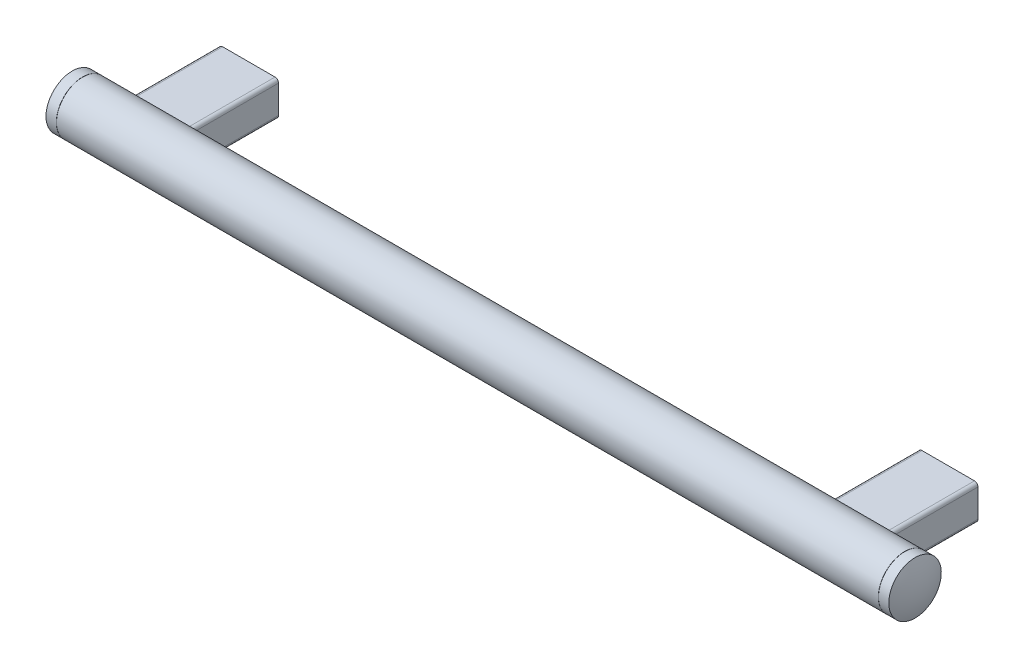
ISO-10303-21;
HEADER;
FILE_DESCRIPTION(('STEP AP214'),'2;1');
FILE_NAME('part.step','',(''),(''),'','','');
FILE_SCHEMA(('AUTOMOTIVE_DESIGN { 1 0 10303 214 1 1 1 1 }'));
ENDSEC;
DATA;
#1=APPLICATION_CONTEXT('core data for automotive mechanical design processes');
#2=APPLICATION_PROTOCOL_DEFINITION('international standard','automotive_design',2000,#1);
#3=PRODUCT_CONTEXT('',#1,'mechanical');
#4=PRODUCT('Part','Part','',(#3));
#5=PRODUCT_RELATED_PRODUCT_CATEGORY('part','',(#4));
#6=PRODUCT_DEFINITION_FORMATION('','',#4);
#7=PRODUCT_DEFINITION_CONTEXT('part definition',#1,'design');
#8=PRODUCT_DEFINITION('design','',#6,#7);
#9=PRODUCT_DEFINITION_SHAPE('','',#8);
#10=(LENGTH_UNIT() NAMED_UNIT(*) SI_UNIT(.MILLI.,.METRE.));
#11=(NAMED_UNIT(*) PLANE_ANGLE_UNIT() SI_UNIT($,.RADIAN.));
#12=(NAMED_UNIT(*) SI_UNIT($,.STERADIAN.) SOLID_ANGLE_UNIT());
#13=UNCERTAINTY_MEASURE_WITH_UNIT(LENGTH_MEASURE(1.E-05),#10,'distance_accuracy_value','');
#14=(GEOMETRIC_REPRESENTATION_CONTEXT(3) GLOBAL_UNCERTAINTY_ASSIGNED_CONTEXT((#13)) GLOBAL_UNIT_ASSIGNED_CONTEXT((#10,
#11,#12)) REPRESENTATION_CONTEXT('',''));
#15=CARTESIAN_POINT('',(0.,0.,0.));
#16=DIRECTION('',(0.,0.,1.));
#17=DIRECTION('',(1.,0.,0.));
#18=AXIS2_PLACEMENT_3D('',#15,#16,#17);
#19=CARTESIAN_POINT('',(0.,0.,17.));
#20=DIRECTION('',(0.,0.,-1.));
#21=DIRECTION('',(0.,1.,0.));
#22=AXIS2_PLACEMENT_3D('',#19,#20,#21);
#23=PLANE('',#22);
#24=CARTESIAN_POINT('',(0.,0.,17.));
#25=DIRECTION('',(0.,0.,-1.));
#26=DIRECTION('',(0.,1.,0.));
#27=AXIS2_PLACEMENT_3D('',#24,#25,#26);
#28=CIRCLE('',#27,3.);
#29=CARTESIAN_POINT('',(0.,3.,17.));
#30=VERTEX_POINT('',#29);
#31=EDGE_CURVE('E209',#30,#30,#28,.T.);
#32=ORIENTED_EDGE('',*,*,#31,.T.);
#33=EDGE_LOOP('',(#32));
#34=FACE_BOUND('',#33,.T.);
#35=ADVANCED_FACE('F14',(#34),#23,.T.);
#36=CARTESIAN_POINT('',(-5.,0.,60.));
#37=DIRECTION('',(1.,0.,0.));
#38=DIRECTION('',(0.,0.,1.));
#39=AXIS2_PLACEMENT_3D('',#36,#37,#38);
#40=SPHERICAL_SURFACE('',#39,39.);
#41=CARTESIAN_POINT('',(-41.,-2.69034686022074E-13,60.));
#42=DIRECTION('',(1.,0.,0.));
#43=DIRECTION('',(0.,1.,0.));
#44=AXIS2_PLACEMENT_3D('',#41,#42,#43);
#45=CIRCLE('',#44,15.);
#46=CARTESIAN_POINT('',(-41.0000000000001,14.9999999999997,60.));
#47=VERTEX_POINT('',#46);
#48=EDGE_CURVE('E322',#47,#47,#45,.T.);
#49=ORIENTED_EDGE('',*,*,#48,.F.);
#50=EDGE_LOOP('',(#49));
#51=FACE_BOUND('',#50,.T.);
#52=ADVANCED_FACE('F16',(#51),#40,.T.);
#53=CARTESIAN_POINT('',(0.,0.,17.));
#54=DIRECTION('',(0.,0.,-1.));
#55=DIRECTION('',(0.,1.,0.));
#56=AXIS2_PLACEMENT_3D('',#53,#54,#55);
#57=CYLINDRICAL_SURFACE('',#56,3.);
#58=ORIENTED_EDGE('',*,*,#31,.F.);
#59=EDGE_LOOP('',(#58));
#60=FACE_BOUND('',#59,.T.);
#61=CARTESIAN_POINT('',(0.,0.,0.));
#62=DIRECTION('',(0.,0.,-1.));
#63=DIRECTION('',(0.,1.,0.));
#64=AXIS2_PLACEMENT_3D('',#61,#62,#63);
#65=CIRCLE('',#64,3.);
#66=CARTESIAN_POINT('',(0.,3.,0.));
#67=VERTEX_POINT('',#66);
#68=EDGE_CURVE('E206',#67,#67,#65,.T.);
#69=ORIENTED_EDGE('',*,*,#68,.T.);
#70=EDGE_LOOP('',(#69));
#71=FACE_BOUND('',#70,.T.);
#72=ADVANCED_FACE('F342',(#60,#71),#57,.F.);
#73=CARTESIAN_POINT('',(-35.,-2.27871649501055E-13,60.));
#74=DIRECTION('',(1.,0.,0.));
#75=DIRECTION('',(0.,1.,0.));
#76=AXIS2_PLACEMENT_3D('',#73,#74,#75);
#77=CYLINDRICAL_SURFACE('',#76,15.);
#78=CARTESIAN_POINT('',(-35.1,-2.28557700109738E-13,60.));
#79=DIRECTION('',(-1.,0.,0.));
#80=DIRECTION('',(0.,-1.,0.));
#81=AXIS2_PLACEMENT_3D('',#78,#79,#80);
#82=CIRCLE('',#81,15.);
#83=CARTESIAN_POINT('',(-35.0999999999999,-15.0000000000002,60.));
#84=VERTEX_POINT('',#83);
#85=EDGE_CURVE('E9',#84,#84,#82,.T.);
#86=ORIENTED_EDGE('',*,*,#85,.T.);
#87=EDGE_LOOP('',(#86));
#88=FACE_BOUND('',#87,.T.);
#89=ORIENTED_EDGE('',*,*,#48,.T.);
#90=EDGE_LOOP('',(#89));
#91=FACE_BOUND('',#90,.T.);
#92=ADVANCED_FACE('F332',(#88,#91),#77,.T.);
#93=CARTESIAN_POINT('',(15.,8.0000000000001,0.));
#94=DIRECTION('',(0.,0.,-1.));
#95=DIRECTION('',(1.,0.,0.));
#96=AXIS2_PLACEMENT_3D('',#93,#94,#95);
#97=PLANE('',#96);
#98=ORIENTED_EDGE('',*,*,#68,.F.);
#99=EDGE_LOOP('',(#98));
#100=FACE_BOUND('',#99,.T.);
#101=CARTESIAN_POINT('',(15.,8.0000000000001,0.));
#102=DIRECTION('',(0.,0.,-1.));
#103=DIRECTION('',(1.,0.,0.));
#104=AXIS2_PLACEMENT_3D('',#101,#102,#103);
#105=CIRCLE('',#104,2.);
#106=CARTESIAN_POINT('',(15.,10.,0.));
#107=VERTEX_POINT('',#106);
#108=CARTESIAN_POINT('',(17.,8.00000000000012,0.));
#109=VERTEX_POINT('',#108);
#110=EDGE_CURVE('E212',#107,#109,#105,.T.);
#111=ORIENTED_EDGE('',*,*,#110,.T.);
#112=DIRECTION('',(0.,-1.,0.));
#113=VECTOR('',#112,1.);
#114=CARTESIAN_POINT('',(17.,8.00000000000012,0.));
#115=LINE('',#114,#113);
#116=CARTESIAN_POINT('',(17.,-7.99999999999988,0.));
#117=VERTEX_POINT('',#116);
#118=EDGE_CURVE('E226',#109,#117,#115,.T.);
#119=ORIENTED_EDGE('',*,*,#118,.T.);
#120=CARTESIAN_POINT('',(15.,-7.9999999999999,0.));
#121=DIRECTION('',(0.,0.,-1.));
#122=DIRECTION('',(1.,0.,0.));
#123=AXIS2_PLACEMENT_3D('',#120,#121,#122);
#124=CIRCLE('',#123,2.);
#125=CARTESIAN_POINT('',(15.,-10.,0.));
#126=VERTEX_POINT('',#125);
#127=EDGE_CURVE('E224',#117,#126,#124,.T.);
#128=ORIENTED_EDGE('',*,*,#127,.T.);
#129=DIRECTION('',(-1.,0.,0.));
#130=VECTOR('',#129,1.);
#131=CARTESIAN_POINT('',(15.,-10.,0.));
#132=LINE('',#131,#130);
#133=CARTESIAN_POINT('',(-15.,-10.,0.));
#134=VERTEX_POINT('',#133);
#135=EDGE_CURVE('E222',#126,#134,#132,.T.);
#136=ORIENTED_EDGE('',*,*,#135,.T.);
#137=CARTESIAN_POINT('',(-15.,-8.0000000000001,0.));
#138=DIRECTION('',(0.,0.,-1.));
#139=DIRECTION('',(1.,0.,0.));
#140=AXIS2_PLACEMENT_3D('',#137,#138,#139);
#141=CIRCLE('',#140,2.);
#142=CARTESIAN_POINT('',(-17.,-8.00000000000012,0.));
#143=VERTEX_POINT('',#142);
#144=EDGE_CURVE('E220',#134,#143,#141,.T.);
#145=ORIENTED_EDGE('',*,*,#144,.T.);
#146=DIRECTION('',(0.,1.,0.));
#147=VECTOR('',#146,1.);
#148=CARTESIAN_POINT('',(-17.,-8.00000000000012,0.));
#149=LINE('',#148,#147);
#150=CARTESIAN_POINT('',(-17.,7.99999999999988,0.));
#151=VERTEX_POINT('',#150);
#152=EDGE_CURVE('E218',#143,#151,#149,.T.);
#153=ORIENTED_EDGE('',*,*,#152,.T.);
#154=CARTESIAN_POINT('',(-15.,7.9999999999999,0.));
#155=DIRECTION('',(0.,0.,-1.));
#156=DIRECTION('',(1.,0.,0.));
#157=AXIS2_PLACEMENT_3D('',#154,#155,#156);
#158=CIRCLE('',#157,2.);
#159=CARTESIAN_POINT('',(-15.,10.,0.));
#160=VERTEX_POINT('',#159);
#161=EDGE_CURVE('E216',#151,#160,#158,.T.);
#162=ORIENTED_EDGE('',*,*,#161,.T.);
#163=DIRECTION('',(1.,0.,0.));
#164=VECTOR('',#163,1.);
#165=CARTESIAN_POINT('',(-15.,10.,0.));
#166=LINE('',#165,#164);
#167=EDGE_CURVE('E213',#160,#107,#166,.T.);
#168=ORIENTED_EDGE('',*,*,#167,.T.);
#169=EDGE_LOOP('',(#111,#119,#128,#136,#145,#153,#162,#168));
#170=FACE_BOUND('',#169,.T.);
#171=ADVANCED_FACE('F330',(#100,#170),#97,.T.);
#172=CARTESIAN_POINT('',(-35.,-2.27871649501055E-13,60.));
#173=DIRECTION('',(-1.,0.,0.));
#174=DIRECTION('',(0.,-1.,0.));
#175=AXIS2_PLACEMENT_3D('',#172,#173,#174);
#176=CONICAL_SURFACE('',#175,14.9,0.785398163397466);
#177=ORIENTED_EDGE('',*,*,#85,.F.);
#178=EDGE_LOOP('',(#177));
#179=FACE_BOUND('',#178,.T.);
#180=CARTESIAN_POINT('',(-35.,-2.27871649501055E-13,60.));
#181=DIRECTION('',(-1.,0.,0.));
#182=DIRECTION('',(0.,-1.,0.));
#183=AXIS2_PLACEMENT_3D('',#180,#181,#182);
#184=CIRCLE('',#183,14.9);
#185=CARTESIAN_POINT('',(-34.9999999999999,-14.9000000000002,60.));
#186=VERTEX_POINT('',#185);
#187=EDGE_CURVE('E22',#186,#186,#184,.F.);
#188=ORIENTED_EDGE('',*,*,#187,.F.);
#189=EDGE_LOOP('',(#188));
#190=FACE_BOUND('',#189,.T.);
#191=ADVANCED_FACE('F308',(#179,#190),#176,.T.);
#192=CARTESIAN_POINT('',(15.,-7.9999999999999,0.));
#193=DIRECTION('',(0.,0.,1.));
#194=DIRECTION('',(-1.,0.,0.));
#195=AXIS2_PLACEMENT_3D('',#192,#193,#194);
#196=CYLINDRICAL_SURFACE('',#195,2.);
#197=CARTESIAN_POINT('',(13.,-7.99999999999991,47.3114224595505));
#198=CARTESIAN_POINT('',(13.0000023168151,-8.14386139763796,47.4021308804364));
#199=CARTESIAN_POINT('',(13.0155259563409,-8.28625788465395,47.4953643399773));
#200=CARTESIAN_POINT('',(13.0758229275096,-8.56371074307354,47.6837058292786));
#201=CARTESIAN_POINT('',(13.1206564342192,-8.69875139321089,47.7788173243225));
#202=CARTESIAN_POINT('',(13.2349554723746,-8.95003632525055,47.9617438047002));
#203=CARTESIAN_POINT('',(13.3028588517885,-9.06691465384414,48.0496641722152));
#204=CARTESIAN_POINT('',(13.4631357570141,-9.28706267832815,48.2199435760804));
#205=CARTESIAN_POINT('',(13.5554607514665,-9.39035876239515,48.3023132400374));
#206=CARTESIAN_POINT('',(13.7336841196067,-9.55123394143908,48.4336095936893));
#207=CARTESIAN_POINT('',(13.8135167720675,-9.6133331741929,48.4852566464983));
#208=CARTESIAN_POINT('',(13.9850088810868,-9.72635405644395,48.5805658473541));
#209=CARTESIAN_POINT('',(14.0766503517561,-9.77729239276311,48.624239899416));
#210=CARTESIAN_POINT('',(14.2529034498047,-9.85726234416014,48.6935123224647));
#211=CARTESIAN_POINT('',(14.3357376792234,-9.88859638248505,48.720955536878));
#212=CARTESIAN_POINT('',(14.507188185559,-9.94039558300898,48.766579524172));
#213=CARTESIAN_POINT('',(14.5958003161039,-9.96086844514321,48.7847668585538));
#214=CARTESIAN_POINT('',(14.7770635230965,-9.98966321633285,48.8104058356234));
#215=CARTESIAN_POINT('',(14.8697344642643,-9.9979163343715,48.8177966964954));
#216=CARTESIAN_POINT('',(15.0555138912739,-10.0013851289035,48.8208987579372));
#217=CARTESIAN_POINT('',(15.1486222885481,-9.99660333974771,48.8166122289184));
#218=CARTESIAN_POINT('',(15.3236977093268,-9.97542143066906,48.7977175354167));
#219=CARTESIAN_POINT('',(15.4059092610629,-9.96011451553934,48.7840808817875));
#220=CARTESIAN_POINT('',(15.5660895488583,-9.91999093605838,48.7485782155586));
#221=CARTESIAN_POINT('',(15.6440574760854,-9.89517246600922,48.7267106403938));
#222=CARTESIAN_POINT('',(15.7999821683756,-9.83508027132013,48.674237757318));
#223=CARTESIAN_POINT('',(15.8775130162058,-9.79916985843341,48.6431064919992));
#224=CARTESIAN_POINT('',(16.0253011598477,-9.71925283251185,48.5746377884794));
#225=CARTESIAN_POINT('',(16.0955525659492,-9.67523974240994,48.5372953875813));
#226=CARTESIAN_POINT('',(16.2620749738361,-9.55636990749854,48.4378021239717));
#227=CARTESIAN_POINT('',(16.353495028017,-9.47718432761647,48.3726678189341));
#228=CARTESIAN_POINT('',(16.518627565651,-9.30686163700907,48.2358889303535));
#229=CARTESIAN_POINT('',(16.5923103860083,-9.21570489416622,48.1642337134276));
#230=CARTESIAN_POINT('',(16.7227715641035,-9.02265032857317,48.0163959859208));
#231=CARTESIAN_POINT('',(16.7792895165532,-8.9206160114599,47.940162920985));
#232=CARTESIAN_POINT('',(16.8736458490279,-8.70912728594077,47.7865564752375));
#233=CARTESIAN_POINT('',(16.9114866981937,-8.5996738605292,47.7091832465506));
#234=CARTESIAN_POINT('',(16.9722292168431,-8.35796248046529,47.543311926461));
#235=CARTESIAN_POINT('',(16.9919212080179,-8.22479320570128,47.4549411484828));
#236=CARTESIAN_POINT('',(17.0040509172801,-7.95466925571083,47.2819435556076));
#237=CARTESIAN_POINT('',(16.9964773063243,-7.81771303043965,47.1973183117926));
#238=CARTESIAN_POINT('',(16.9529013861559,-7.5479211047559,47.0364770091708));
#239=CARTESIAN_POINT('',(16.9176078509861,-7.4150673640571,46.960104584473));
#240=CARTESIAN_POINT('',(16.8182830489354,-7.15555538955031,46.8159187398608));
#241=CARTESIAN_POINT('',(16.7542827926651,-7.02889063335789,46.7480961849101));
#242=CARTESIAN_POINT('',(16.6077870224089,-6.80389422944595,46.631341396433));
#243=CARTESIAN_POINT('',(16.5287203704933,-6.70401274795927,46.5811018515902));
#244=CARTESIAN_POINT('',(16.3502883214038,-6.51906286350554,46.4902837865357));
#245=CARTESIAN_POINT('',(16.2509443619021,-6.43397899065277,46.449695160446));
#246=CARTESIAN_POINT('',(16.0496639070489,-6.29378739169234,46.3840743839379));
#247=CARTESIAN_POINT('',(15.9499072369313,-6.23617899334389,46.3576788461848));
#248=CARTESIAN_POINT('',(15.7404007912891,-6.13851290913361,46.3134536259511));
#249=CARTESIAN_POINT('',(15.6306571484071,-6.09844453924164,46.2956187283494));
#250=CARTESIAN_POINT('',(15.4147576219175,-6.04056991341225,46.2700171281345));
#251=CARTESIAN_POINT('',(15.3091262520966,-6.0211242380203,46.2615068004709));
#252=CARTESIAN_POINT('',(15.0957874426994,-5.99942292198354,46.2520156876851));
#253=CARTESIAN_POINT('',(14.9880805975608,-5.99716243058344,46.2510327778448));
#254=CARTESIAN_POINT('',(14.7777746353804,-6.00969461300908,46.2565067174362));
#255=CARTESIAN_POINT('',(14.6751312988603,-6.02387585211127,46.2626968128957));
#256=CARTESIAN_POINT('',(14.4738867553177,-6.06769355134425,46.281994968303));
#257=CARTESIAN_POINT('',(14.3752853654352,-6.09732931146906,46.2951027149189));
#258=CARTESIAN_POINT('',(14.1842523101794,-6.1710398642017,46.3281349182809));
#259=CARTESIAN_POINT('',(14.0918564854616,-6.21519107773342,46.3480954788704));
#260=CARTESIAN_POINT('',(13.9160688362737,-6.3161436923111,46.3945082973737));
#261=CARTESIAN_POINT('',(13.8326780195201,-6.37294650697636,46.4209612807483));
#262=CARTESIAN_POINT('',(13.6732429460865,-6.49982014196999,46.481218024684));
#263=CARTESIAN_POINT('',(13.5976745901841,-6.57035979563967,46.5152909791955));
#264=CARTESIAN_POINT('',(13.4595254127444,-6.72041002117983,46.5894410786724));
#265=CARTESIAN_POINT('',(13.3969495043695,-6.79992396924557,46.6295204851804));
#266=CARTESIAN_POINT('',(13.2808729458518,-6.97225102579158,46.7185142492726));
#267=CARTESIAN_POINT('',(13.2285510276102,-7.06562015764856,46.7678851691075));
#268=CARTESIAN_POINT('',(13.1401606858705,-7.25695759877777,46.8718461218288));
#269=CARTESIAN_POINT('',(13.1040923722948,-7.35492593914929,46.9264361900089));
#270=CARTESIAN_POINT('',(13.0503538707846,-7.54425766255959,47.0348536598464));
#271=CARTESIAN_POINT('',(13.0313508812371,-7.63544968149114,47.08833048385));
#272=CARTESIAN_POINT('',(13.0061708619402,-7.81795534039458,47.1980102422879));
#273=CARTESIAN_POINT('',(12.9999985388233,-7.90926901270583,47.2542141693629));
#274=CARTESIAN_POINT('',(13.,-7.99999999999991,47.3114224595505));
#275=B_SPLINE_CURVE_WITH_KNOTS('',3,(#197,#198,#199,#200,#201,#202,#203,#204,#205,#206,#207,
#208,#209,#210,#211,#212,#213,#214,#215,#216,#217,#218,#219,#220,#221,#222,#223,#224,#225,#226,
#227,#228,#229,#230,#231,#232,#233,#234,#235,#236,#237,#238,#239,#240,#241,#242,#243,#244,#245,
#246,#247,#248,#249,#250,#251,#252,#253,#254,#255,#256,#257,#258,#259,#260,#261,#262,#263,#264,
#265,#266,#267,#268,#269,#270,#271,#272,#273,#274),.UNSPECIFIED.,.T.,.F.,(4,2,2,2,2,2,2,2,2,2,2,
2,2,2,2,2,2,2,2,2,2,2,2,2,2,2,2,2,2,2,2,2,2,2,2,2,2,2,4),(0.,0.50977099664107,1.02059188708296,
1.50208208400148,1.98262254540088,2.32213593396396,2.66113819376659,2.93816857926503,
3.21500230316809,3.4933886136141,3.77172080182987,4.02480636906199,4.27794000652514,
4.54976470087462,4.82180763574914,5.23168501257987,5.6422431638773,6.05875006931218,
6.47520189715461,6.95596901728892,7.43693592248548,7.90599013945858,8.37453887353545,
8.78294034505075,9.19091226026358,9.54354102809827,9.89595470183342,10.2175724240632,
10.5390993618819,10.8490427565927,11.1589721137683,11.4705600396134,11.7821827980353,
12.1073297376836,12.4325994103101,12.7847727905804,13.1369485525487,13.4583347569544,
13.7798388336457),.UNSPECIFIED.);
#276=CARTESIAN_POINT('',(15.,-10.,48.819660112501));
#277=VERTEX_POINT('',#276);
#278=CARTESIAN_POINT('',(17.,-7.99999999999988,47.3114224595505));
#279=VERTEX_POINT('',#278);
#280=EDGE_CURVE('E296',#277,#279,#275,.T.);
#281=ORIENTED_EDGE('',*,*,#280,.F.);
#282=DIRECTION('',(0.,0.,1.));
#283=VECTOR('',#282,1.);
#284=CARTESIAN_POINT('',(15.,-10.,0.));
#285=LINE('',#284,#283);
#286=EDGE_CURVE('E236',#126,#277,#285,.T.);
#287=ORIENTED_EDGE('',*,*,#286,.F.);
#288=ORIENTED_EDGE('',*,*,#127,.F.);
#289=DIRECTION('',(0.,0.,1.));
#290=VECTOR('',#289,1.);
#291=CARTESIAN_POINT('',(17.,-7.99999999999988,0.));
#292=LINE('',#291,#290);
#293=EDGE_CURVE('E233',#117,#279,#292,.T.);
#294=ORIENTED_EDGE('',*,*,#293,.T.);
#295=EDGE_LOOP('',(#281,#287,#288,#294));
#296=FACE_BOUND('',#295,.T.);
#297=ADVANCED_FACE('F304',(#296),#196,.T.);
#298=CARTESIAN_POINT('',(15.,-10.,0.));
#299=DIRECTION('',(0.,1.,0.));
#300=DIRECTION('',(1.,0.,0.));
#301=AXIS2_PLACEMENT_3D('',#298,#299,#300);
#302=PLANE('',#301);
#303=DIRECTION('',(1.,0.,0.));
#304=VECTOR('',#303,1.);
#305=CARTESIAN_POINT('',(-35.,-10.0000000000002,48.819660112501));
#306=LINE('',#305,#304);
#307=CARTESIAN_POINT('',(-15.,-10.,48.8196601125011));
#308=VERTEX_POINT('',#307);
#309=EDGE_CURVE('E293',#308,#277,#306,.T.);
#310=ORIENTED_EDGE('',*,*,#309,.F.);
#311=DIRECTION('',(0.,0.,1.));
#312=VECTOR('',#311,1.);
#313=CARTESIAN_POINT('',(-15.,-10.,0.));
#314=LINE('',#313,#312);
#315=EDGE_CURVE('E239',#134,#308,#314,.T.);
#316=ORIENTED_EDGE('',*,*,#315,.F.);
#317=ORIENTED_EDGE('',*,*,#135,.F.);
#318=ORIENTED_EDGE('',*,*,#286,.T.);
#319=EDGE_LOOP('',(#310,#316,#317,#318));
#320=FACE_BOUND('',#319,.T.);
#321=ADVANCED_FACE('F284',(#320),#302,.F.);
#322=CARTESIAN_POINT('',(-15.,-8.0000000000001,0.));
#323=DIRECTION('',(0.,0.,1.));
#324=DIRECTION('',(-1.,0.,0.));
#325=AXIS2_PLACEMENT_3D('',#322,#323,#324);
#326=CYLINDRICAL_SURFACE('',#325,2.);
#327=CARTESIAN_POINT('',(-17.,-8.00000000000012,47.3114224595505));
#328=CARTESIAN_POINT('',(-16.9999976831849,-8.14386139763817,47.4021308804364));
#329=CARTESIAN_POINT('',(-16.9844740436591,-8.28625788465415,47.4953643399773));
#330=CARTESIAN_POINT('',(-16.9241770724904,-8.56371074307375,47.6837058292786));
#331=CARTESIAN_POINT('',(-16.8793435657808,-8.69875139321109,47.7788173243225));
#332=CARTESIAN_POINT('',(-16.7650445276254,-8.95003632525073,47.9617438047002));
#333=CARTESIAN_POINT('',(-16.6971411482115,-9.06691465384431,48.0496641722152));
#334=CARTESIAN_POINT('',(-16.5368642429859,-9.28706267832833,48.2199435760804));
#335=CARTESIAN_POINT('',(-16.4445392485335,-9.39035876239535,48.3023132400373));
#336=CARTESIAN_POINT('',(-16.2663158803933,-9.55123394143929,48.4336095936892));
#337=CARTESIAN_POINT('',(-16.1864832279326,-9.61333317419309,48.4852566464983));
#338=CARTESIAN_POINT('',(-16.0149911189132,-9.72635405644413,48.5805658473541));
#339=CARTESIAN_POINT('',(-15.9233496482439,-9.77729239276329,48.624239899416));
#340=CARTESIAN_POINT('',(-15.7470965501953,-9.85726234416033,48.6935123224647));
#341=CARTESIAN_POINT('',(-15.6642623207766,-9.88859638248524,48.720955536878));
#342=CARTESIAN_POINT('',(-15.492811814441,-9.94039558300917,48.7665795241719));
#343=CARTESIAN_POINT('',(-15.4041996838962,-9.96086844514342,48.7847668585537));
#344=CARTESIAN_POINT('',(-15.2229364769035,-9.98966321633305,48.8104058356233));
#345=CARTESIAN_POINT('',(-15.1302655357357,-9.9979163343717,48.8177966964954));
#346=CARTESIAN_POINT('',(-14.9444861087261,-10.0013851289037,48.8208987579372));
#347=CARTESIAN_POINT('',(-14.8513777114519,-9.99660333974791,48.8166122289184));
#348=CARTESIAN_POINT('',(-14.6763022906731,-9.97542143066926,48.7977175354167));
#349=CARTESIAN_POINT('',(-14.5940907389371,-9.96011451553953,48.7840808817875));
#350=CARTESIAN_POINT('',(-14.4339104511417,-9.91999093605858,48.7485782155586));
#351=CARTESIAN_POINT('',(-14.3559425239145,-9.89517246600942,48.7267106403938));
#352=CARTESIAN_POINT('',(-14.2000178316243,-9.83508027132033,48.674237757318));
#353=CARTESIAN_POINT('',(-14.1224869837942,-9.7991698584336,48.6431064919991));
#354=CARTESIAN_POINT('',(-13.9746988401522,-9.71925283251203,48.5746377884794));
#355=CARTESIAN_POINT('',(-13.9044474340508,-9.67523974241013,48.5372953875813));
#356=CARTESIAN_POINT('',(-13.7379250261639,-9.55636990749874,48.4378021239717));
#357=CARTESIAN_POINT('',(-13.646504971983,-9.47718432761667,48.3726678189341));
#358=CARTESIAN_POINT('',(-13.481372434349,-9.30686163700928,48.2358889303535));
#359=CARTESIAN_POINT('',(-13.4076896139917,-9.21570489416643,48.1642337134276));
#360=CARTESIAN_POINT('',(-13.2772284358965,-9.02265032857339,48.0163959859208));
#361=CARTESIAN_POINT('',(-13.2207104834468,-8.92061601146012,47.9401629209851));
#362=CARTESIAN_POINT('',(-13.1263541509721,-8.70912728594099,47.7865564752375));
#363=CARTESIAN_POINT('',(-13.0885133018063,-8.59967386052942,47.7091832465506));
#364=CARTESIAN_POINT('',(-13.0277707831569,-8.35796248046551,47.543311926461));
#365=CARTESIAN_POINT('',(-13.0080787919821,-8.2247932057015,47.4549411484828));
#366=CARTESIAN_POINT('',(-12.9959490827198,-7.95466925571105,47.2819435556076));
#367=CARTESIAN_POINT('',(-13.0035226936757,-7.81771303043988,47.1973183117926));
#368=CARTESIAN_POINT('',(-13.0470986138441,-7.54792110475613,47.0364770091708));
#369=CARTESIAN_POINT('',(-13.0823921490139,-7.41506736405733,46.960104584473));
#370=CARTESIAN_POINT('',(-13.1817169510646,-7.15555538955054,46.8159187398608));
#371=CARTESIAN_POINT('',(-13.2457172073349,-7.02889063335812,46.7480961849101));
#372=CARTESIAN_POINT('',(-13.392212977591,-6.80389422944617,46.631341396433));
#373=CARTESIAN_POINT('',(-13.4712796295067,-6.70401274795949,46.5811018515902));
#374=CARTESIAN_POINT('',(-13.6497116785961,-6.51906286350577,46.4902837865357));
#375=CARTESIAN_POINT('',(-13.7490556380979,-6.433978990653,46.449695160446));
#376=CARTESIAN_POINT('',(-13.950336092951,-6.29378739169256,46.3840743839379));
#377=CARTESIAN_POINT('',(-14.0500927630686,-6.23617899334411,46.3576788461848));
#378=CARTESIAN_POINT('',(-14.2595992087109,-6.13851290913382,46.3134536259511));
#379=CARTESIAN_POINT('',(-14.3693428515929,-6.09844453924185,46.2956187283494));
#380=CARTESIAN_POINT('',(-14.5852423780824,-6.04056991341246,46.2700171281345));
#381=CARTESIAN_POINT('',(-14.6908737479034,-6.02112423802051,46.2615068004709));
#382=CARTESIAN_POINT('',(-14.9042125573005,-5.99942292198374,46.2520156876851));
#383=CARTESIAN_POINT('',(-15.0119194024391,-5.99716243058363,46.2510327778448));
#384=CARTESIAN_POINT('',(-15.2222253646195,-6.00969461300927,46.2565067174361));
#385=CARTESIAN_POINT('',(-15.3248687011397,-6.02387585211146,46.2626968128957));
#386=CARTESIAN_POINT('',(-15.5261132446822,-6.06769355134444,46.281994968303));
#387=CARTESIAN_POINT('',(-15.6247146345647,-6.09732931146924,46.2951027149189));
#388=CARTESIAN_POINT('',(-15.8157476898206,-6.17103986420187,46.3281349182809));
#389=CARTESIAN_POINT('',(-15.9081435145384,-6.21519107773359,46.3480954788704));
#390=CARTESIAN_POINT('',(-16.0839311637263,-6.31614369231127,46.3945082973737));
#391=CARTESIAN_POINT('',(-16.1673219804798,-6.37294650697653,46.4209612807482));
#392=CARTESIAN_POINT('',(-16.3267570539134,-6.49982014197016,46.4812180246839));
#393=CARTESIAN_POINT('',(-16.4023254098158,-6.57035979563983,46.5152909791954));
#394=CARTESIAN_POINT('',(-16.5404745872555,-6.72041002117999,46.5894410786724));
#395=CARTESIAN_POINT('',(-16.6030504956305,-6.79992396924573,46.6295204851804));
#396=CARTESIAN_POINT('',(-16.7191270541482,-6.97225102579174,46.7185142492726));
#397=CARTESIAN_POINT('',(-16.7714489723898,-7.06562015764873,46.7678851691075));
#398=CARTESIAN_POINT('',(-16.8598393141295,-7.25695759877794,46.8718461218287));
#399=CARTESIAN_POINT('',(-16.8959076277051,-7.35492593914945,46.9264361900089));
#400=CARTESIAN_POINT('',(-16.9496461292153,-7.54425766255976,47.0348536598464));
#401=CARTESIAN_POINT('',(-16.9686491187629,-7.63544968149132,47.08833048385));
#402=CARTESIAN_POINT('',(-16.9938291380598,-7.81795534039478,47.1980102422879));
#403=CARTESIAN_POINT('',(-17.0000014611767,-7.90926901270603,47.2542141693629));
#404=CARTESIAN_POINT('',(-17.,-8.00000000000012,47.3114224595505));
#405=B_SPLINE_CURVE_WITH_KNOTS('',3,(#327,#328,#329,#330,#331,#332,#333,#334,#335,#336,#337,
#338,#339,#340,#341,#342,#343,#344,#345,#346,#347,#348,#349,#350,#351,#352,#353,#354,#355,#356,
#357,#358,#359,#360,#361,#362,#363,#364,#365,#366,#367,#368,#369,#370,#371,#372,#373,#374,#375,
#376,#377,#378,#379,#380,#381,#382,#383,#384,#385,#386,#387,#388,#389,#390,#391,#392,#393,#394,
#395,#396,#397,#398,#399,#400,#401,#402,#403,#404),.UNSPECIFIED.,.T.,.F.,(4,2,2,2,2,2,2,2,2,2,2,
2,2,2,2,2,2,2,2,2,2,2,2,2,2,2,2,2,2,2,2,2,2,2,2,2,2,2,4),(0.,0.509770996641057,1.02059188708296,
1.50208208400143,1.98262254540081,2.32213593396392,2.66113819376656,2.93816857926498,
3.21500230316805,3.49338861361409,3.77172080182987,4.024806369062,4.27794000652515,
4.54976470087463,4.82180763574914,5.23168501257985,5.64224316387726,6.05875006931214,
6.47520189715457,6.95596901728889,7.43693592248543,7.90599013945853,8.37453887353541,
8.78294034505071,9.19091226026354,9.54354102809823,9.89595470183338,10.2175724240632,
10.5390993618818,10.8490427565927,11.1589721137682,11.4705600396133,11.7821827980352,
12.1073297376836,12.4325994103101,12.7847727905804,13.1369485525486,13.4583347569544,
13.7798388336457),.UNSPECIFIED.);
#406=CARTESIAN_POINT('',(-17.,-8.00000000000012,47.3114224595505));
#407=VERTEX_POINT('',#406);
#408=EDGE_CURVE('E287',#407,#308,#405,.T.);
#409=ORIENTED_EDGE('',*,*,#408,.F.);
#410=DIRECTION('',(0.,0.,1.));
#411=VECTOR('',#410,1.);
#412=CARTESIAN_POINT('',(-17.,-8.00000000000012,0.));
#413=LINE('',#412,#411);
#414=EDGE_CURVE('E242',#143,#407,#413,.T.);
#415=ORIENTED_EDGE('',*,*,#414,.F.);
#416=ORIENTED_EDGE('',*,*,#144,.F.);
#417=ORIENTED_EDGE('',*,*,#315,.T.);
#418=EDGE_LOOP('',(#409,#415,#416,#417));
#419=FACE_BOUND('',#418,.T.);
#420=ADVANCED_FACE('F279',(#419),#326,.T.);
#421=CARTESIAN_POINT('',(-17.,-8.00000000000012,0.));
#422=DIRECTION('',(1.,0.,0.));
#423=DIRECTION('',(0.,0.,1.));
#424=AXIS2_PLACEMENT_3D('',#421,#422,#423);
#425=PLANE('',#424);
#426=CARTESIAN_POINT('',(-17.,-1.18710434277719E-13,60.));
#427=DIRECTION('',(1.,0.,0.));
#428=DIRECTION('',(0.,0.,1.));
#429=AXIS2_PLACEMENT_3D('',#426,#427,#428);
#430=CIRCLE('',#429,15.);
#431=CARTESIAN_POINT('',(-17.,7.99999999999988,47.3114224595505));
#432=VERTEX_POINT('',#431);
#433=EDGE_CURVE('E263',#432,#407,#430,.F.);
#434=ORIENTED_EDGE('',*,*,#433,.F.);
#435=DIRECTION('',(0.,0.,1.));
#436=VECTOR('',#435,1.);
#437=CARTESIAN_POINT('',(-17.,7.99999999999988,0.));
#438=LINE('',#437,#436);
#439=EDGE_CURVE('E245',#151,#432,#438,.T.);
#440=ORIENTED_EDGE('',*,*,#439,.F.);
#441=ORIENTED_EDGE('',*,*,#152,.F.);
#442=ORIENTED_EDGE('',*,*,#414,.T.);
#443=EDGE_LOOP('',(#434,#440,#441,#442));
#444=FACE_BOUND('',#443,.T.);
#445=ADVANCED_FACE('F274',(#444),#425,.F.);
#446=CARTESIAN_POINT('',(-15.,7.9999999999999,0.));
#447=DIRECTION('',(0.,0.,1.));
#448=DIRECTION('',(-1.,0.,0.));
#449=AXIS2_PLACEMENT_3D('',#446,#447,#448);
#450=CYLINDRICAL_SURFACE('',#449,2.);
#451=CARTESIAN_POINT('',(-17.,7.99999999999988,47.3114224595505));
#452=CARTESIAN_POINT('',(-16.9999991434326,7.87909476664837,47.2351918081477));
#453=CARTESIAN_POINT('',(-16.9890388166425,7.75708923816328,47.1607041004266));
#454=CARTESIAN_POINT('',(-16.944013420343,7.51414460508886,47.0170299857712));
#455=CARTESIAN_POINT('',(-16.909954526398,7.39320522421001,46.9478421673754));
#456=CARTESIAN_POINT('',(-16.8175938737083,7.15580080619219,46.8161820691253));
#457=CARTESIAN_POINT('',(-16.7591388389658,7.03936923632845,46.7537554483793));
#458=CARTESIAN_POINT('',(-16.6180104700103,6.81706769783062,46.6379910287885));
#459=CARTESIAN_POINT('',(-16.5353548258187,6.71119009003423,46.5846466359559));
#460=CARTESIAN_POINT('',(-16.3589136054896,6.52774525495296,46.4945296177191));
#461=CARTESIAN_POINT('',(-16.2677073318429,6.44830074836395,46.4565302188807));
#462=CARTESIAN_POINT('',(-16.0701948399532,6.30605393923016,46.3897143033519));
#463=CARTESIAN_POINT('',(-15.9639012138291,6.24323788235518,46.3608901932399));
#464=CARTESIAN_POINT('',(-15.7525224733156,6.14371866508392,46.3157983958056));
#465=CARTESIAN_POINT('',(-15.6486727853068,6.10485920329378,46.298476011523));
#466=CARTESIAN_POINT('',(-15.4350253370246,6.04473842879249,46.2718452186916));
#467=CARTESIAN_POINT('',(-15.3252301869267,6.02346945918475,46.2625333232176));
#468=CARTESIAN_POINT('',(-15.1101174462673,6.00028628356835,46.2523925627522));
#469=CARTESIAN_POINT('',(-15.0049409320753,5.99726003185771,46.2510762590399));
#470=CARTESIAN_POINT('',(-14.795579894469,6.00771705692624,46.2556422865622));
#471=CARTESIAN_POINT('',(-14.6913952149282,6.02119769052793,46.2615234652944));
#472=CARTESIAN_POINT('',(-14.4886277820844,6.06374928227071,46.2802526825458));
#473=CARTESIAN_POINT('',(-14.3899832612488,6.09257556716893,46.2929914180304));
#474=CARTESIAN_POINT('',(-14.1992155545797,6.16447906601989,46.3251786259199));
#475=CARTESIAN_POINT('',(-14.1070926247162,6.20755683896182,46.3446273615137));
#476=CARTESIAN_POINT('',(-13.9295504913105,6.30744168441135,46.3904718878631));
#477=CARTESIAN_POINT('',(-13.8443382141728,6.36454602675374,46.417019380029));
#478=CARTESIAN_POINT('',(-13.6849200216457,6.48975291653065,46.4763947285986));
#479=CARTESIAN_POINT('',(-13.6107163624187,6.55785771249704,46.5092238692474));
#480=CARTESIAN_POINT('',(-13.4703450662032,6.7072135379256,46.5828236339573));
#481=CARTESIAN_POINT('',(-13.4049591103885,6.78901734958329,46.6239600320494));
#482=CARTESIAN_POINT('',(-13.288789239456,6.95960528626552,46.7119184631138));
#483=CARTESIAN_POINT('',(-13.2380106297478,7.04839193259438,46.7587425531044));
#484=CARTESIAN_POINT('',(-13.146904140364,7.23951560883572,46.8621785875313));
#485=CARTESIAN_POINT('',(-13.1081365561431,7.34231828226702,46.9193012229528));
#486=CARTESIAN_POINT('',(-13.0482089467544,7.55028832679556,47.0382283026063));
#487=CARTESIAN_POINT('',(-13.0270567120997,7.65545672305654,47.1000348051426));
#488=CARTESIAN_POINT('',(-13.0000866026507,7.87914859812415,47.2352758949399));
#489=CARTESIAN_POINT('',(-12.9965732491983,7.9976616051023,47.309187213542));
#490=CARTESIAN_POINT('',(-13.0100119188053,8.23176813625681,47.459768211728));
#491=CARTESIAN_POINT('',(-13.026978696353,8.34735949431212,47.5364398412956));
#492=CARTESIAN_POINT('',(-13.0835973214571,8.5867568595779,47.6999585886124));
#493=CARTESIAN_POINT('',(-13.1257113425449,8.70990049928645,47.786929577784));
#494=CARTESIAN_POINT('',(-13.2334577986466,8.9467076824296,47.9593245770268));
#495=CARTESIAN_POINT('',(-13.2990930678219,9.06037008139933,48.0447483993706));
#496=CARTESIAN_POINT('',(-13.4423655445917,9.25960123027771,48.1985889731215));
#497=CARTESIAN_POINT('',(-13.5169227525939,9.34685994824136,48.2676856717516));
#498=CARTESIAN_POINT('',(-13.6829377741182,9.50957472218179,48.3991861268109));
#499=CARTESIAN_POINT('',(-13.7743716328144,9.58504723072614,48.4615991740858));
#500=CARTESIAN_POINT('',(-13.9509067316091,9.70530243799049,48.5627005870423));
#501=CARTESIAN_POINT('',(-14.0326722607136,9.75315622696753,48.603550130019));
#502=CARTESIAN_POINT('',(-14.2053049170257,9.83784302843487,48.6765742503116));
#503=CARTESIAN_POINT('',(-14.296160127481,9.87469022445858,48.7087599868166));
#504=CARTESIAN_POINT('',(-14.4712701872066,9.9306990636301,48.758007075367));
#505=CARTESIAN_POINT('',(-14.554509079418,9.95167197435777,48.7766025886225));
#506=CARTESIAN_POINT('',(-14.7245244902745,9.98281750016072,48.8042955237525));
#507=CARTESIAN_POINT('',(-14.8112988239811,9.99299668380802,48.8133987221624));
#508=CARTESIAN_POINT('',(-14.9861247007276,10.0018703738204,48.8213315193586));
#509=CARTESIAN_POINT('',(-15.0741788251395,10.0005370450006,48.8201362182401));
#510=CARTESIAN_POINT('',(-15.2486141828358,9.98641726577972,48.8075224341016));
#511=CARTESIAN_POINT('',(-15.3349950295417,9.97362820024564,48.7961016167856));
#512=CARTESIAN_POINT('',(-15.5009447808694,9.93804813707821,48.7645323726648));
#513=CARTESIAN_POINT('',(-15.5806434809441,9.91559258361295,48.7446769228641));
#514=CARTESIAN_POINT('',(-15.7347280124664,9.86194601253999,48.6976421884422));
#515=CARTESIAN_POINT('',(-15.8091112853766,9.83075082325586,48.6704594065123));
#516=CARTESIAN_POINT('',(-15.9806238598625,9.74666189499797,48.5979492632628));
#517=CARTESIAN_POINT('',(-16.0747398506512,9.69009939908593,48.5497345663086));
#518=CARTESIAN_POINT('',(-16.2497262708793,9.56518206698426,48.4451760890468));
#519=CARTESIAN_POINT('',(-16.3305694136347,9.49680351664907,48.3888159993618));
#520=CARTESIAN_POINT('',(-16.497930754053,9.331678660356,48.2554817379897));
#521=CARTESIAN_POINT('',(-16.5804869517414,9.23217372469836,48.1769512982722));
#522=CARTESIAN_POINT('',(-16.7240153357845,9.02177052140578,48.0156229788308));
#523=CARTESIAN_POINT('',(-16.7849693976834,8.9108627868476,47.932821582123));
#524=CARTESIAN_POINT('',(-16.8890292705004,8.67085776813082,47.7590885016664));
#525=CARTESIAN_POINT('',(-16.9302441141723,8.54101472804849,47.6680503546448));
#526=CARTESIAN_POINT('',(-16.9857218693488,8.27458961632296,47.4877259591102));
#527=CARTESIAN_POINT('',(-17.0000009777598,8.13801164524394,47.3984386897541));
#528=CARTESIAN_POINT('',(-17.,7.99999999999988,47.3114224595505));
#529=B_SPLINE_CURVE_WITH_KNOTS('',3,(#451,#452,#453,#454,#455,#456,#457,#458,#459,#460,#461,
#462,#463,#464,#465,#466,#467,#468,#469,#470,#471,#472,#473,#474,#475,#476,#477,#478,#479,#480,
#481,#482,#483,#484,#485,#486,#487,#488,#489,#490,#491,#492,#493,#494,#495,#496,#497,#498,#499,
#500,#501,#502,#503,#504,#505,#506,#507,#508,#509,#510,#511,#512,#513,#514,#515,#516,#517,#518,
#519,#520,#521,#522,#523,#524,#525,#526,#527,#528),.UNSPECIFIED.,.T.,.F.,(4,2,2,2,2,2,2,2,2,2,2,
2,2,2,2,2,2,2,2,2,2,2,2,2,2,2,2,2,2,2,2,2,2,2,2,2,2,2,4),(0.,0.428302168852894,
0.856489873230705,1.28740928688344,1.71801449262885,2.09620696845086,2.47408563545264,
2.80902084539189,3.14381018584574,3.45796652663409,3.77207256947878,4.08131419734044,
4.39056795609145,4.70704747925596,5.02359177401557,5.35972890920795,5.69598797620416,
6.06599418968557,6.43616395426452,6.85362917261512,7.27139532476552,7.73894100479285,
8.206543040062,8.60695107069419,9.00679507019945,9.31517612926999,9.6231580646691,
9.88551744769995,10.1477170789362,10.4105508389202,10.6734446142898,10.9278702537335,
11.1824175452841,11.5402241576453,11.8987573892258,12.3502378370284,12.8020961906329,
13.2912914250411,13.7801924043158),.UNSPECIFIED.);
#530=CARTESIAN_POINT('',(-15.,10.,48.8196601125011));
#531=VERTEX_POINT('',#530);
#532=EDGE_CURVE('E255',#531,#432,#529,.T.);
#533=ORIENTED_EDGE('',*,*,#532,.F.);
#534=DIRECTION('',(0.,0.,1.));
#535=VECTOR('',#534,1.);
#536=CARTESIAN_POINT('',(-15.,10.,0.));
#537=LINE('',#536,#535);
#538=EDGE_CURVE('E29',#160,#531,#537,.T.);
#539=ORIENTED_EDGE('',*,*,#538,.F.);
#540=ORIENTED_EDGE('',*,*,#161,.F.);
#541=ORIENTED_EDGE('',*,*,#439,.T.);
#542=EDGE_LOOP('',(#533,#539,#540,#541));
#543=FACE_BOUND('',#542,.T.);
#544=ADVANCED_FACE('F268',(#543),#450,.T.);
#545=CARTESIAN_POINT('',(-15.,10.,0.));
#546=DIRECTION('',(0.,-1.,0.));
#547=DIRECTION('',(-1.,0.,0.));
#548=AXIS2_PLACEMENT_3D('',#545,#546,#547);
#549=PLANE('',#548);
#550=DIRECTION('',(1.,0.,0.));
#551=VECTOR('',#550,1.);
#552=CARTESIAN_POINT('',(-35.,9.99999999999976,48.8196601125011));
#553=LINE('',#552,#551);
#554=CARTESIAN_POINT('',(15.,10.,48.8196601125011));
#555=VERTEX_POINT('',#554);
#556=EDGE_CURVE('E252',#555,#531,#553,.F.);
#557=ORIENTED_EDGE('',*,*,#556,.F.);
#558=DIRECTION('',(0.,0.,1.));
#559=VECTOR('',#558,1.);
#560=CARTESIAN_POINT('',(15.,10.,0.));
#561=LINE('',#560,#559);
#562=EDGE_CURVE('E215',#107,#555,#561,.T.);
#563=ORIENTED_EDGE('',*,*,#562,.F.);
#564=ORIENTED_EDGE('',*,*,#167,.F.);
#565=ORIENTED_EDGE('',*,*,#538,.T.);
#566=EDGE_LOOP('',(#557,#563,#564,#565));
#567=FACE_BOUND('',#566,.T.);
#568=ADVANCED_FACE('F273',(#567),#549,.F.);
#569=CARTESIAN_POINT('',(15.,8.0000000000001,0.));
#570=DIRECTION('',(0.,0.,1.));
#571=DIRECTION('',(-1.,0.,0.));
#572=AXIS2_PLACEMENT_3D('',#569,#570,#571);
#573=CYLINDRICAL_SURFACE('',#572,2.);
#574=CARTESIAN_POINT('',(13.,8.00000000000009,47.3114224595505));
#575=CARTESIAN_POINT('',(13.0000008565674,7.87909476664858,47.2351918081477));
#576=CARTESIAN_POINT('',(13.0109611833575,7.75708923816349,47.1607041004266));
#577=CARTESIAN_POINT('',(13.055986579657,7.51414460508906,47.0170299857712));
#578=CARTESIAN_POINT('',(13.090045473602,7.39320522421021,46.9478421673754));
#579=CARTESIAN_POINT('',(13.1824061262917,7.15580080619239,46.8161820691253));
#580=CARTESIAN_POINT('',(13.2408611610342,7.03936923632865,46.7537554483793));
#581=CARTESIAN_POINT('',(13.3819895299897,6.81706769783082,46.6379910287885));
#582=CARTESIAN_POINT('',(13.4646451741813,6.71119009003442,46.5846466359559));
#583=CARTESIAN_POINT('',(13.6410863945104,6.52774525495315,46.4945296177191));
#584=CARTESIAN_POINT('',(13.7322926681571,6.44830074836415,46.4565302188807));
#585=CARTESIAN_POINT('',(13.9298051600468,6.30605393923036,46.3897143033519));
#586=CARTESIAN_POINT('',(14.0360987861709,6.24323788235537,46.3608901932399));
#587=CARTESIAN_POINT('',(14.2474775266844,6.14371866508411,46.3157983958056));
#588=CARTESIAN_POINT('',(14.3513272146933,6.10485920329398,46.298476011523));
#589=CARTESIAN_POINT('',(14.5649746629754,6.04473842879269,46.2718452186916));
#590=CARTESIAN_POINT('',(14.6747698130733,6.02346945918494,46.2625333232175));
#591=CARTESIAN_POINT('',(14.8898825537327,6.00028628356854,46.2523925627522));
#592=CARTESIAN_POINT('',(14.9950590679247,5.99726003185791,46.2510762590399));
#593=CARTESIAN_POINT('',(15.204420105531,6.00771705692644,46.2556422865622));
#594=CARTESIAN_POINT('',(15.3086047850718,6.02119769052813,46.2615234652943));
#595=CARTESIAN_POINT('',(15.5113722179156,6.06374928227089,46.2802526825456));
#596=CARTESIAN_POINT('',(15.6100167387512,6.09257556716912,46.2929914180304));
#597=CARTESIAN_POINT('',(15.8007844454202,6.16447906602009,46.3251786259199));
#598=CARTESIAN_POINT('',(15.8929073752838,6.20755683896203,46.3446273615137));
#599=CARTESIAN_POINT('',(16.0704495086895,6.30744168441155,46.3904718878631));
#600=CARTESIAN_POINT('',(16.1556617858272,6.36454602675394,46.417019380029));
#601=CARTESIAN_POINT('',(16.3150799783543,6.48975291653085,46.4763947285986));
#602=CARTESIAN_POINT('',(16.3892836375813,6.55785771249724,46.5092238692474));
#603=CARTESIAN_POINT('',(16.5296549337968,6.7072135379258,46.5828236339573));
#604=CARTESIAN_POINT('',(16.5950408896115,6.78901734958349,46.6239600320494));
#605=CARTESIAN_POINT('',(16.711210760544,6.95960528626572,46.7119184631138));
#606=CARTESIAN_POINT('',(16.7619893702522,7.04839193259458,46.7587425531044));
#607=CARTESIAN_POINT('',(16.853095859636,7.23951560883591,46.8621785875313));
#608=CARTESIAN_POINT('',(16.8918634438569,7.34231828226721,46.9193012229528));
#609=CARTESIAN_POINT('',(16.9517910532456,7.55028832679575,47.0382283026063));
#610=CARTESIAN_POINT('',(16.9729432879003,7.65545672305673,47.1000348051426));
#611=CARTESIAN_POINT('',(16.9999133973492,7.87914859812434,47.23527589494));
#612=CARTESIAN_POINT('',(17.0034267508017,7.9976616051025,47.309187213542));
#613=CARTESIAN_POINT('',(16.9899880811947,8.23176813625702,47.4597682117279));
#614=CARTESIAN_POINT('',(16.9730213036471,8.34735949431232,47.5364398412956));
#615=CARTESIAN_POINT('',(16.9164026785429,8.5867568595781,47.6999585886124));
#616=CARTESIAN_POINT('',(16.8742886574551,8.70990049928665,47.786929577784));
#617=CARTESIAN_POINT('',(16.7665422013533,8.94670768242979,47.9593245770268));
#618=CARTESIAN_POINT('',(16.7009069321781,9.06037008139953,48.0447483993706));
#619=CARTESIAN_POINT('',(16.5576344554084,9.2596012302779,48.1985889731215));
#620=CARTESIAN_POINT('',(16.4830772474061,9.34685994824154,48.2676856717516));
#621=CARTESIAN_POINT('',(16.3170622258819,9.50957472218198,48.3991861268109));
#622=CARTESIAN_POINT('',(16.2256283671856,9.58504723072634,48.4615991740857));
#623=CARTESIAN_POINT('',(16.0490932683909,9.7053024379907,48.5627005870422));
#624=CARTESIAN_POINT('',(15.9673277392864,9.75315622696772,48.603550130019));
#625=CARTESIAN_POINT('',(15.7946950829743,9.83784302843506,48.6765742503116));
#626=CARTESIAN_POINT('',(15.7038398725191,9.87469022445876,48.7087599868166));
#627=CARTESIAN_POINT('',(15.5287298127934,9.93069906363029,48.758007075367));
#628=CARTESIAN_POINT('',(15.445490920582,9.95167197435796,48.7766025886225));
#629=CARTESIAN_POINT('',(15.2754755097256,9.98281750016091,48.8042955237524));
#630=CARTESIAN_POINT('',(15.188701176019,9.99299668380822,48.8133987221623));
#631=CARTESIAN_POINT('',(15.0138752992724,10.0018703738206,48.8213315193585));
#632=CARTESIAN_POINT('',(14.9258211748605,10.0005370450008,48.8201362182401));
#633=CARTESIAN_POINT('',(14.7513858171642,9.98641726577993,48.8075224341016));
#634=CARTESIAN_POINT('',(14.6650049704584,9.97362820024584,48.7961016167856));
#635=CARTESIAN_POINT('',(14.4990552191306,9.93804813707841,48.7645323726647));
#636=CARTESIAN_POINT('',(14.4193565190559,9.91559258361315,48.7446769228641));
#637=CARTESIAN_POINT('',(14.2652719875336,9.86194601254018,48.6976421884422));
#638=CARTESIAN_POINT('',(14.1908887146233,9.83075082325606,48.6704594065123));
#639=CARTESIAN_POINT('',(14.0193761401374,9.74666189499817,48.5979492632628));
#640=CARTESIAN_POINT('',(13.9252601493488,9.69009939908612,48.5497345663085));
#641=CARTESIAN_POINT('',(13.7502737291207,9.56518206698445,48.4451760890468));
#642=CARTESIAN_POINT('',(13.6694305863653,9.49680351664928,48.3888159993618));
#643=CARTESIAN_POINT('',(13.5020692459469,9.33167866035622,48.2554817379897));
#644=CARTESIAN_POINT('',(13.4195130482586,9.23217372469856,48.1769512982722));
#645=CARTESIAN_POINT('',(13.2759846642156,9.02177052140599,48.0156229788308));
#646=CARTESIAN_POINT('',(13.2150306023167,8.91086278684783,47.932821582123));
#647=CARTESIAN_POINT('',(13.1109707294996,8.67085776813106,47.7590885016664));
#648=CARTESIAN_POINT('',(13.0697558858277,8.54101472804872,47.6680503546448));
#649=CARTESIAN_POINT('',(13.0142781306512,8.27458961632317,47.4877259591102));
#650=CARTESIAN_POINT('',(12.9999990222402,8.13801164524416,47.3984386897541));
#651=CARTESIAN_POINT('',(13.,8.00000000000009,47.3114224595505));
#652=B_SPLINE_CURVE_WITH_KNOTS('',3,(#574,#575,#576,#577,#578,#579,#580,#581,#582,#583,#584,
#585,#586,#587,#588,#589,#590,#591,#592,#593,#594,#595,#596,#597,#598,#599,#600,#601,#602,#603,
#604,#605,#606,#607,#608,#609,#610,#611,#612,#613,#614,#615,#616,#617,#618,#619,#620,#621,#622,
#623,#624,#625,#626,#627,#628,#629,#630,#631,#632,#633,#634,#635,#636,#637,#638,#639,#640,#641,
#642,#643,#644,#645,#646,#647,#648,#649,#650,#651),.UNSPECIFIED.,.T.,.F.,(4,2,2,2,2,2,2,2,2,2,2,
2,2,2,2,2,2,2,2,2,2,2,2,2,2,2,2,2,2,2,2,2,2,2,2,2,2,2,4),(0.,0.428302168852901,
0.856489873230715,1.28740928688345,1.71801449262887,2.09620696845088,2.47408563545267,
2.80902084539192,3.14381018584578,3.45796652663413,3.7720725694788,4.08131419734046,
4.39056795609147,4.70704747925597,5.0235917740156,5.35972890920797,5.69598797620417,
6.06599418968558,6.43616395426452,6.85362917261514,7.27139532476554,7.73894100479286,
8.20654304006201,8.60695107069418,9.00679507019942,9.31517612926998,9.6231580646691,
9.88551744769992,10.1477170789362,10.4105508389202,10.6734446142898,10.9278702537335,
11.1824175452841,11.5402241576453,11.8987573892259,12.3502378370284,12.8020961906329,
13.2912914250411,13.7801924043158),.UNSPECIFIED.);
#653=CARTESIAN_POINT('',(17.,8.00000000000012,47.3114224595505));
#654=VERTEX_POINT('',#653);
#655=EDGE_CURVE('E37',#654,#555,#652,.T.);
#656=ORIENTED_EDGE('',*,*,#655,.F.);
#657=DIRECTION('',(0.,0.,1.));
#658=VECTOR('',#657,1.);
#659=CARTESIAN_POINT('',(17.,8.00000000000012,0.));
#660=LINE('',#659,#658);
#661=EDGE_CURVE('E230',#109,#654,#660,.T.);
#662=ORIENTED_EDGE('',*,*,#661,.F.);
#663=ORIENTED_EDGE('',*,*,#110,.F.);
#664=ORIENTED_EDGE('',*,*,#562,.T.);
#665=EDGE_LOOP('',(#656,#662,#663,#664));
#666=FACE_BOUND('',#665,.T.);
#667=ADVANCED_FACE('F314',(#666),#573,.T.);
#668=CARTESIAN_POINT('',(17.,8.00000000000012,0.));
#669=DIRECTION('',(-1.,0.,0.));
#670=DIRECTION('',(0.,0.,-1.));
#671=AXIS2_PLACEMENT_3D('',#668,#669,#670);
#672=PLANE('',#671);
#673=CARTESIAN_POINT('',(17.,1.18710434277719E-13,60.));
#674=DIRECTION('',(-1.,0.,0.));
#675=DIRECTION('',(0.,0.,-1.));
#676=AXIS2_PLACEMENT_3D('',#673,#674,#675);
#677=CIRCLE('',#676,15.);
#678=EDGE_CURVE('E302',#279,#654,#677,.F.);
#679=ORIENTED_EDGE('',*,*,#678,.F.);
#680=ORIENTED_EDGE('',*,*,#293,.F.);
#681=ORIENTED_EDGE('',*,*,#118,.F.);
#682=ORIENTED_EDGE('',*,*,#661,.T.);
#683=EDGE_LOOP('',(#679,#680,#681,#682));
#684=FACE_BOUND('',#683,.T.);
#685=ADVANCED_FACE('F310',(#684),#672,.F.);
#686=CARTESIAN_POINT('',(-35.,-2.44403835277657E-13,60.));
#687=DIRECTION('',(-1.,0.,0.));
#688=DIRECTION('',(0.,0.,-1.));
#689=AXIS2_PLACEMENT_3D('',#686,#687,#688);
#690=PLANE('',#689);
#691=ORIENTED_EDGE('',*,*,#187,.T.);
#692=EDGE_LOOP('',(#691));
#693=FACE_BOUND('',#692,.T.);
#694=CARTESIAN_POINT('',(-35.,-2.44403835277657E-13,60.));
#695=DIRECTION('',(1.,0.,0.));
#696=DIRECTION('',(0.,1.,0.));
#697=AXIS2_PLACEMENT_3D('',#694,#695,#696);
#698=CIRCLE('',#697,15.);
#699=CARTESIAN_POINT('',(-35.0000000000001,14.9999999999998,60.));
#700=VERTEX_POINT('',#699);
#701=EDGE_CURVE('E232',#700,#700,#698,.T.);
#702=ORIENTED_EDGE('',*,*,#701,.F.);
#703=EDGE_LOOP('',(#702));
#704=FACE_BOUND('',#703,.T.);
#705=ADVANCED_FACE('F313',(#693,#704),#690,.T.);
#706=CARTESIAN_POINT('',(-35.,-2.44403835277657E-13,60.));
#707=DIRECTION('',(1.,0.,0.));
#708=DIRECTION('',(0.,1.,0.));
#709=AXIS2_PLACEMENT_3D('',#706,#707,#708);
#710=CYLINDRICAL_SURFACE('',#709,15.);
#711=ORIENTED_EDGE('',*,*,#701,.T.);
#712=EDGE_LOOP('',(#711));
#713=FACE_BOUND('',#712,.T.);
#714=ORIENTED_EDGE('',*,*,#678,.T.);
#715=ORIENTED_EDGE('',*,*,#655,.T.);
#716=ORIENTED_EDGE('',*,*,#556,.T.);
#717=ORIENTED_EDGE('',*,*,#532,.T.);
#718=ORIENTED_EDGE('',*,*,#433,.T.);
#719=ORIENTED_EDGE('',*,*,#408,.T.);
#720=ORIENTED_EDGE('',*,*,#309,.T.);
#721=ORIENTED_EDGE('',*,*,#280,.T.);
#722=EDGE_LOOP('',(#714,#715,#716,#717,#718,#719,#720,#721));
#723=FACE_BOUND('',#722,.T.);
#724=CARTESIAN_POINT('',(435.,1.64099717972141E-12,60.));
#725=DIRECTION('',(-1.,0.,0.));
#726=DIRECTION('',(0.,1.,0.));
#727=AXIS2_PLACEMENT_3D('',#724,#725,#726);
#728=CIRCLE('',#727,15.);
#729=CARTESIAN_POINT('',(435.,15.0000000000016,60.));
#730=VERTEX_POINT('',#729);
#731=EDGE_CURVE('E156',#730,#730,#728,.T.);
#732=ORIENTED_EDGE('',*,*,#731,.T.);
#733=EDGE_LOOP('',(#732));
#734=FACE_BOUND('',#733,.T.);
#735=CARTESIAN_POINT('',(417.,1.51530377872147E-12,60.));
#736=DIRECTION('',(-1.,0.,0.));
#737=DIRECTION('',(0.,0.,-1.));
#738=AXIS2_PLACEMENT_3D('',#735,#736,#737);
#739=CIRCLE('',#738,15.);
#740=CARTESIAN_POINT('',(417.,-7.99999999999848,47.3114224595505));
#741=VERTEX_POINT('',#740);
#742=CARTESIAN_POINT('',(417.,8.00000000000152,47.3114224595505));
#743=VERTEX_POINT('',#742);
#744=EDGE_CURVE('E386',#741,#743,#739,.F.);
#745=ORIENTED_EDGE('',*,*,#744,.T.);
#746=CARTESIAN_POINT('',(413.,8.00000000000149,47.3114224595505));
#747=CARTESIAN_POINT('',(413.000000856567,7.87909476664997,47.2351918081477));
#748=CARTESIAN_POINT('',(413.010961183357,7.75708923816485,47.1607041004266));
#749=CARTESIAN_POINT('',(413.055986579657,7.51414460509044,47.0170299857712));
#750=CARTESIAN_POINT('',(413.090045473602,7.39320522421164,46.9478421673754));
#751=CARTESIAN_POINT('',(413.182406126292,7.15580080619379,46.8161820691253));
#752=CARTESIAN_POINT('',(413.240861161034,7.03936923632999,46.7537554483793));
#753=CARTESIAN_POINT('',(413.38198952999,6.81706769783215,46.6379910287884));
#754=CARTESIAN_POINT('',(413.464645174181,6.71119009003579,46.5846466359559));
#755=CARTESIAN_POINT('',(413.64108639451,6.52774525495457,46.4945296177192));
#756=CARTESIAN_POINT('',(413.732292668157,6.44830074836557,46.4565302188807));
#757=CARTESIAN_POINT('',(413.929805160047,6.30605393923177,46.3897143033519));
#758=CARTESIAN_POINT('',(414.036098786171,6.24323788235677,46.3608901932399));
#759=CARTESIAN_POINT('',(414.247477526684,6.14371866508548,46.3157983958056));
#760=CARTESIAN_POINT('',(414.351327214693,6.10485920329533,46.298476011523));
#761=CARTESIAN_POINT('',(414.564974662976,6.04473842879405,46.2718452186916));
#762=CARTESIAN_POINT('',(414.674769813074,6.02346945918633,46.2625333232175));
#763=CARTESIAN_POINT('',(414.889882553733,6.00028628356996,46.2523925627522));
#764=CARTESIAN_POINT('',(414.995059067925,5.99726003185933,46.2510762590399));
#765=CARTESIAN_POINT('',(415.204420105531,6.00771705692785,46.2556422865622));
#766=CARTESIAN_POINT('',(415.308604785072,6.02119769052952,46.2615234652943));
#767=CARTESIAN_POINT('',(415.511372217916,6.06374928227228,46.2802526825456));
#768=CARTESIAN_POINT('',(415.610016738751,6.0925755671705,46.2929914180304));
#769=CARTESIAN_POINT('',(415.80078444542,6.16447906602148,46.3251786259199));
#770=CARTESIAN_POINT('',(415.892907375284,6.20755683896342,46.3446273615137));
#771=CARTESIAN_POINT('',(416.070449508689,6.30744168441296,46.3904718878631));
#772=CARTESIAN_POINT('',(416.155661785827,6.36454602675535,46.417019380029));
#773=CARTESIAN_POINT('',(416.315079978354,6.48975291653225,46.4763947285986));
#774=CARTESIAN_POINT('',(416.389283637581,6.55785771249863,46.5092238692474));
#775=CARTESIAN_POINT('',(416.529654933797,6.70721353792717,46.5828236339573));
#776=CARTESIAN_POINT('',(416.595040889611,6.78901734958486,46.6239600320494));
#777=CARTESIAN_POINT('',(416.711210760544,6.95960528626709,46.7119184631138));
#778=CARTESIAN_POINT('',(416.761989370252,7.04839193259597,46.7587425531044));
#779=CARTESIAN_POINT('',(416.853095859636,7.23951560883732,46.8621785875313));
#780=CARTESIAN_POINT('',(416.891863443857,7.3423182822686,46.9193012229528));
#781=CARTESIAN_POINT('',(416.951791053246,7.55028832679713,47.0382283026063));
#782=CARTESIAN_POINT('',(416.9729432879,7.65545672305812,47.1000348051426));
#783=CARTESIAN_POINT('',(416.999913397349,7.87914859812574,47.2352758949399));
#784=CARTESIAN_POINT('',(417.003426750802,7.99766160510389,47.309187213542));
#785=CARTESIAN_POINT('',(416.989988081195,8.2317681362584,47.4597682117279));
#786=CARTESIAN_POINT('',(416.973021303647,8.34735949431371,47.5364398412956));
#787=CARTESIAN_POINT('',(416.916402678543,8.58675685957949,47.6999585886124));
#788=CARTESIAN_POINT('',(416.874288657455,8.70990049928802,47.786929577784));
#789=CARTESIAN_POINT('',(416.766542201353,8.94670768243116,47.9593245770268));
#790=CARTESIAN_POINT('',(416.700906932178,9.0603700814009,48.0447483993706));
#791=CARTESIAN_POINT('',(416.557634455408,9.25960123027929,48.1985889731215));
#792=CARTESIAN_POINT('',(416.483077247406,9.34685994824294,48.2676856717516));
#793=CARTESIAN_POINT('',(416.317062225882,9.50957472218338,48.3991861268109));
#794=CARTESIAN_POINT('',(416.225628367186,9.58504723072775,48.4615991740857));
#795=CARTESIAN_POINT('',(416.049093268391,9.70530243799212,48.5627005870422));
#796=CARTESIAN_POINT('',(415.967327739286,9.75315622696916,48.603550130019));
#797=CARTESIAN_POINT('',(415.794695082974,9.83784302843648,48.6765742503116));
#798=CARTESIAN_POINT('',(415.703839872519,9.87469022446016,48.7087599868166));
#799=CARTESIAN_POINT('',(415.528729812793,9.93069906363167,48.758007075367));
#800=CARTESIAN_POINT('',(415.445490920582,9.95167197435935,48.7766025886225));
#801=CARTESIAN_POINT('',(415.275475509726,9.98281750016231,48.8042955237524));
#802=CARTESIAN_POINT('',(415.188701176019,9.9929966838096,48.8133987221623));
#803=CARTESIAN_POINT('',(415.013875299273,10.001870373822,48.8213315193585));
#804=CARTESIAN_POINT('',(414.925821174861,10.0005370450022,48.8201362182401));
#805=CARTESIAN_POINT('',(414.751385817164,9.98641726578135,48.8075224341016));
#806=CARTESIAN_POINT('',(414.665004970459,9.97362820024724,48.7961016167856));
#807=CARTESIAN_POINT('',(414.499055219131,9.93804813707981,48.7645323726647));
#808=CARTESIAN_POINT('',(414.419356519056,9.91559258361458,48.7446769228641));
#809=CARTESIAN_POINT('',(414.265271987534,9.86194601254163,48.6976421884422));
#810=CARTESIAN_POINT('',(414.190888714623,9.83075082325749,48.6704594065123));
#811=CARTESIAN_POINT('',(414.019376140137,9.74666189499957,48.5979492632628));
#812=CARTESIAN_POINT('',(413.925260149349,9.69009939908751,48.5497345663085));
#813=CARTESIAN_POINT('',(413.750273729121,9.56518206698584,48.4451760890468));
#814=CARTESIAN_POINT('',(413.669430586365,9.49680351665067,48.3888159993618));
#815=CARTESIAN_POINT('',(413.502069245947,9.33167866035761,48.2554817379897));
#816=CARTESIAN_POINT('',(413.419513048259,9.23217372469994,48.1769512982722));
#817=CARTESIAN_POINT('',(413.275984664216,9.02177052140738,48.0156229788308));
#818=CARTESIAN_POINT('',(413.215030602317,8.91086278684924,47.932821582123));
#819=CARTESIAN_POINT('',(413.110970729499,8.67085776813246,47.7590885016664));
#820=CARTESIAN_POINT('',(413.069755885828,8.5410147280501,47.6680503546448));
#821=CARTESIAN_POINT('',(413.014278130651,8.27458961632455,47.4877259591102));
#822=CARTESIAN_POINT('',(412.99999902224,8.13801164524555,47.3984386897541));
#823=CARTESIAN_POINT('',(413.,8.00000000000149,47.3114224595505));
#824=B_SPLINE_CURVE_WITH_KNOTS('',3,(#746,#747,#748,#749,#750,#751,#752,#753,#754,#755,#756,
#757,#758,#759,#760,#761,#762,#763,#764,#765,#766,#767,#768,#769,#770,#771,#772,#773,#774,#775,
#776,#777,#778,#779,#780,#781,#782,#783,#784,#785,#786,#787,#788,#789,#790,#791,#792,#793,#794,
#795,#796,#797,#798,#799,#800,#801,#802,#803,#804,#805,#806,#807,#808,#809,#810,#811,#812,#813,
#814,#815,#816,#817,#818,#819,#820,#821,#822,#823),.UNSPECIFIED.,.T.,.F.,(4,2,2,2,2,2,2,2,2,2,2,
2,2,2,2,2,2,2,2,2,2,2,2,2,2,2,2,2,2,2,2,2,2,2,2,2,2,2,4),(0.,0.428302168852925,
0.856489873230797,1.28740928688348,1.71801449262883,2.09620696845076,2.47408563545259,
2.80902084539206,3.143810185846,3.45796652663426,3.77207256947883,4.08131419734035,
4.39056795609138,4.70704747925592,5.02359177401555,5.35972890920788,5.69598797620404,
6.0659941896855,6.43616395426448,6.85362917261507,7.27139532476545,7.73894100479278,
8.20654304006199,8.60695107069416,9.00679507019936,9.31517612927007,9.62315806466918,
9.88551744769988,10.147717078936,10.4105508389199,10.6734446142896,10.9278702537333,
11.1824175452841,11.5402241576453,11.8987573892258,12.3502378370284,12.8020961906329,
13.2912914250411,13.7801924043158),.UNSPECIFIED.);
#825=CARTESIAN_POINT('',(415.,10.0000000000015,48.8196601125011));
#826=VERTEX_POINT('',#825);
#827=EDGE_CURVE('E155',#743,#826,#824,.T.);
#828=ORIENTED_EDGE('',*,*,#827,.T.);
#829=DIRECTION('',(1.,0.,0.));
#830=VECTOR('',#829,1.);
#831=CARTESIAN_POINT('',(165.,9.99999999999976,48.8196601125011));
#832=LINE('',#831,#830);
#833=CARTESIAN_POINT('',(385.,10.0000000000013,48.8196601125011));
#834=VERTEX_POINT('',#833);
#835=EDGE_CURVE('E135',#826,#834,#832,.F.);
#836=ORIENTED_EDGE('',*,*,#835,.T.);
#837=CARTESIAN_POINT('',(383.,8.00000000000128,47.3114224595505));
#838=CARTESIAN_POINT('',(383.000000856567,7.87909476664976,47.2351918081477));
#839=CARTESIAN_POINT('',(383.010961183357,7.75708923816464,47.1607041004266));
#840=CARTESIAN_POINT('',(383.055986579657,7.51414460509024,47.0170299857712));
#841=CARTESIAN_POINT('',(383.090045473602,7.39320522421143,46.9478421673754));
#842=CARTESIAN_POINT('',(383.182406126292,7.15580080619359,46.8161820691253));
#843=CARTESIAN_POINT('',(383.240861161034,7.03936923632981,46.7537554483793));
#844=CARTESIAN_POINT('',(383.38198952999,6.81706769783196,46.6379910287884));
#845=CARTESIAN_POINT('',(383.464645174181,6.71119009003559,46.5846466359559));
#846=CARTESIAN_POINT('',(383.64108639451,6.52774525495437,46.4945296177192));
#847=CARTESIAN_POINT('',(383.732292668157,6.44830074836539,46.4565302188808));
#848=CARTESIAN_POINT('',(383.929805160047,6.3060539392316,46.3897143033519));
#849=CARTESIAN_POINT('',(384.036098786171,6.24323788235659,46.3608901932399));
#850=CARTESIAN_POINT('',(384.247477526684,6.14371866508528,46.3157983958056));
#851=CARTESIAN_POINT('',(384.351327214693,6.10485920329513,46.298476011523));
#852=CARTESIAN_POINT('',(384.564974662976,6.04473842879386,46.2718452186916));
#853=CARTESIAN_POINT('',(384.674769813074,6.02346945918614,46.2625333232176));
#854=CARTESIAN_POINT('',(384.889882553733,6.00028628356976,46.2523925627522));
#855=CARTESIAN_POINT('',(384.995059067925,5.99726003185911,46.2510762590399));
#856=CARTESIAN_POINT('',(385.204420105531,6.00771705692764,46.2556422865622));
#857=CARTESIAN_POINT('',(385.308604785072,6.02119769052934,46.2615234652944));
#858=CARTESIAN_POINT('',(385.511372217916,6.0637492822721,46.2802526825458));
#859=CARTESIAN_POINT('',(385.610016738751,6.09257556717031,46.2929914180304));
#860=CARTESIAN_POINT('',(385.80078444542,6.16447906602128,46.3251786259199));
#861=CARTESIAN_POINT('',(385.892907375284,6.20755683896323,46.3446273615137));
#862=CARTESIAN_POINT('',(386.07044950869,6.30744168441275,46.3904718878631));
#863=CARTESIAN_POINT('',(386.155661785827,6.36454602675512,46.417019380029));
#864=CARTESIAN_POINT('',(386.315079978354,6.48975291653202,46.4763947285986));
#865=CARTESIAN_POINT('',(386.389283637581,6.55785771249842,46.5092238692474));
#866=CARTESIAN_POINT('',(386.529654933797,6.70721353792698,46.5828236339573));
#867=CARTESIAN_POINT('',(386.595040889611,6.78901734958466,46.6239600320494));
#868=CARTESIAN_POINT('',(386.711210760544,6.9596052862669,46.7119184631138));
#869=CARTESIAN_POINT('',(386.761989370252,7.04839193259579,46.7587425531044));
#870=CARTESIAN_POINT('',(386.853095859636,7.23951560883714,46.8621785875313));
#871=CARTESIAN_POINT('',(386.891863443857,7.3423182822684,46.9193012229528));
#872=CARTESIAN_POINT('',(386.951791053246,7.55028832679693,47.0382283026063));
#873=CARTESIAN_POINT('',(386.9729432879,7.65545672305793,47.1000348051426));
#874=CARTESIAN_POINT('',(386.999913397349,7.87914859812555,47.23527589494));
#875=CARTESIAN_POINT('',(387.003426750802,7.99766160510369,47.309187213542));
#876=CARTESIAN_POINT('',(386.989988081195,8.23176813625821,47.459768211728));
#877=CARTESIAN_POINT('',(386.973021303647,8.34735949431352,47.5364398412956));
#878=CARTESIAN_POINT('',(386.916402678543,8.58675685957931,47.6999585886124));
#879=CARTESIAN_POINT('',(386.874288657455,8.70990049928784,47.786929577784));
#880=CARTESIAN_POINT('',(386.766542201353,8.94670768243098,47.9593245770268));
#881=CARTESIAN_POINT('',(386.700906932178,9.06037008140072,48.0447483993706));
#882=CARTESIAN_POINT('',(386.557634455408,9.2596012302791,48.1985889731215));
#883=CARTESIAN_POINT('',(386.483077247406,9.34685994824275,48.2676856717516));
#884=CARTESIAN_POINT('',(386.317062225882,9.50957472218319,48.3991861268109));
#885=CARTESIAN_POINT('',(386.225628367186,9.58504723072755,48.4615991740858));
#886=CARTESIAN_POINT('',(386.049093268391,9.70530243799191,48.5627005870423));
#887=CARTESIAN_POINT('',(385.967327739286,9.75315622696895,48.6035501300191));
#888=CARTESIAN_POINT('',(385.794695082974,9.83784302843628,48.6765742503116));
#889=CARTESIAN_POINT('',(385.703839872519,9.87469022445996,48.7087599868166));
#890=CARTESIAN_POINT('',(385.528729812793,9.93069906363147,48.758007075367));
#891=CARTESIAN_POINT('',(385.445490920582,9.95167197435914,48.7766025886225));
#892=CARTESIAN_POINT('',(385.275475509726,9.9828175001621,48.8042955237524));
#893=CARTESIAN_POINT('',(385.188701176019,9.99299668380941,48.8133987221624));
#894=CARTESIAN_POINT('',(385.013875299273,10.0018703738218,48.8213315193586));
#895=CARTESIAN_POINT('',(384.925821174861,10.000537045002,48.8201362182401));
#896=CARTESIAN_POINT('',(384.751385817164,9.98641726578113,48.8075224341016));
#897=CARTESIAN_POINT('',(384.665004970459,9.97362820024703,48.7961016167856));
#898=CARTESIAN_POINT('',(384.499055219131,9.9380481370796,48.7645323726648));
#899=CARTESIAN_POINT('',(384.419356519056,9.91559258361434,48.7446769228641));
#900=CARTESIAN_POINT('',(384.265271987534,9.86194601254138,48.6976421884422));
#901=CARTESIAN_POINT('',(384.190888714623,9.83075082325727,48.6704594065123));
#902=CARTESIAN_POINT('',(384.019376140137,9.74666189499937,48.5979492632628));
#903=CARTESIAN_POINT('',(383.925260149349,9.69009939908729,48.5497345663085));
#904=CARTESIAN_POINT('',(383.750273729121,9.56518206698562,48.4451760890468));
#905=CARTESIAN_POINT('',(383.669430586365,9.49680351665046,48.3888159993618));
#906=CARTESIAN_POINT('',(383.502069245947,9.3316786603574,48.2554817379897));
#907=CARTESIAN_POINT('',(383.419513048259,9.23217372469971,48.1769512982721));
#908=CARTESIAN_POINT('',(383.275984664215,9.02177052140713,48.0156229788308));
#909=CARTESIAN_POINT('',(383.215030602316,8.91086278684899,47.932821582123));
#910=CARTESIAN_POINT('',(383.110970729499,8.67085776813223,47.7590885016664));
#911=CARTESIAN_POINT('',(383.069755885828,8.54101472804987,47.6680503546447));
#912=CARTESIAN_POINT('',(383.014278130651,8.27458961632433,47.4877259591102));
#913=CARTESIAN_POINT('',(382.99999902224,8.13801164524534,47.3984386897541));
#914=CARTESIAN_POINT('',(383.,8.00000000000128,47.3114224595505));
#915=B_SPLINE_CURVE_WITH_KNOTS('',3,(#837,#838,#839,#840,#841,#842,#843,#844,#845,#846,#847,
#848,#849,#850,#851,#852,#853,#854,#855,#856,#857,#858,#859,#860,#861,#862,#863,#864,#865,#866,
#867,#868,#869,#870,#871,#872,#873,#874,#875,#876,#877,#878,#879,#880,#881,#882,#883,#884,#885,
#886,#887,#888,#889,#890,#891,#892,#893,#894,#895,#896,#897,#898,#899,#900,#901,#902,#903,#904,
#905,#906,#907,#908,#909,#910,#911,#912,#913,#914),.UNSPECIFIED.,.T.,.F.,(4,2,2,2,2,2,2,2,2,2,2,
2,2,2,2,2,2,2,2,2,2,2,2,2,2,2,2,2,2,2,2,2,2,2,2,2,2,2,4),(0.,0.428302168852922,
0.856489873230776,1.28740928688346,1.7180144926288,2.09620696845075,2.47408563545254,
2.80902084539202,3.14381018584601,3.45796652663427,3.77207256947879,4.0813141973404,
4.39056795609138,4.7070474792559,5.02359177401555,5.35972890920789,5.69598797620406,
6.0659941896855,6.43616395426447,6.85362917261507,7.27139532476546,7.73894100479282,
8.206543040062,8.60695107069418,9.00679507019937,9.31517612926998,9.62315806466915,
9.88551744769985,10.1477170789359,10.41055083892,10.6734446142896,10.9278702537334,
11.1824175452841,11.5402241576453,11.8987573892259,12.3502378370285,12.802096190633,
13.2912914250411,13.7801924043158),.UNSPECIFIED.);
#916=CARTESIAN_POINT('',(383.,8.00000000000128,47.3114224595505));
#917=VERTEX_POINT('',#916);
#918=EDGE_CURVE('E145',#834,#917,#915,.T.);
#919=ORIENTED_EDGE('',*,*,#918,.T.);
#920=CARTESIAN_POINT('',(383.,1.27788291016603E-12,60.));
#921=DIRECTION('',(1.,0.,0.));
#922=DIRECTION('',(0.,0.,1.));
#923=AXIS2_PLACEMENT_3D('',#920,#921,#922);
#924=CIRCLE('',#923,15.);
#925=CARTESIAN_POINT('',(383.,-7.99999999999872,47.3114224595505));
#926=VERTEX_POINT('',#925);
#927=EDGE_CURVE('E150',#917,#926,#924,.F.);
#928=ORIENTED_EDGE('',*,*,#927,.T.);
#929=CARTESIAN_POINT('',(383.,-7.99999999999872,47.3114224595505));
#930=CARTESIAN_POINT('',(383.000002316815,-8.14386139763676,47.4021308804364));
#931=CARTESIAN_POINT('',(383.015525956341,-8.28625788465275,47.4953643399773));
#932=CARTESIAN_POINT('',(383.07582292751,-8.56371074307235,47.6837058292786));
#933=CARTESIAN_POINT('',(383.120656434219,-8.6987513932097,47.7788173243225));
#934=CARTESIAN_POINT('',(383.234955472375,-8.95003632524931,47.9617438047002));
#935=CARTESIAN_POINT('',(383.302858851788,-9.06691465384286,48.0496641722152));
#936=CARTESIAN_POINT('',(383.463135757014,-9.28706267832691,48.2199435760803));
#937=CARTESIAN_POINT('',(383.555460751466,-9.39035876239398,48.3023132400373));
#938=CARTESIAN_POINT('',(383.733684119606,-9.55123394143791,48.4336095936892));
#939=CARTESIAN_POINT('',(383.813516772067,-9.61333317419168,48.4852566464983));
#940=CARTESIAN_POINT('',(383.985008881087,-9.7263540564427,48.5805658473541));
#941=CARTESIAN_POINT('',(384.076650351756,-9.77729239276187,48.6242398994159));
#942=CARTESIAN_POINT('',(384.252903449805,-9.85726234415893,48.6935123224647));
#943=CARTESIAN_POINT('',(384.335737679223,-9.88859638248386,48.720955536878));
#944=CARTESIAN_POINT('',(384.507188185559,-9.9403955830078,48.7665795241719));
#945=CARTESIAN_POINT('',(384.595800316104,-9.96086844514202,48.7847668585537));
#946=CARTESIAN_POINT('',(384.777063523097,-9.98966321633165,48.8104058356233));
#947=CARTESIAN_POINT('',(384.869734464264,-9.99791633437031,48.8177966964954));
#948=CARTESIAN_POINT('',(385.055513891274,-10.0013851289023,48.8208987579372));
#949=CARTESIAN_POINT('',(385.148622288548,-9.99660333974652,48.8166122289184));
#950=CARTESIAN_POINT('',(385.323697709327,-9.97542143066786,48.7977175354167));
#951=CARTESIAN_POINT('',(385.405909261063,-9.96011451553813,48.7840808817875));
#952=CARTESIAN_POINT('',(385.566089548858,-9.91999093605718,48.7485782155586));
#953=CARTESIAN_POINT('',(385.644057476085,-9.89517246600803,48.7267106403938));
#954=CARTESIAN_POINT('',(385.799982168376,-9.83508027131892,48.674237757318));
#955=CARTESIAN_POINT('',(385.877513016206,-9.79916985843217,48.6431064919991));
#956=CARTESIAN_POINT('',(386.025301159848,-9.71925283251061,48.5746377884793));
#957=CARTESIAN_POINT('',(386.095552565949,-9.67523974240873,48.5372953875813));
#958=CARTESIAN_POINT('',(386.262074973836,-9.55636990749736,48.4378021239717));
#959=CARTESIAN_POINT('',(386.353495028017,-9.47718432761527,48.3726678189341));
#960=CARTESIAN_POINT('',(386.518627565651,-9.30686163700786,48.2358889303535));
#961=CARTESIAN_POINT('',(386.592310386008,-9.21570489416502,48.1642337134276));
#962=CARTESIAN_POINT('',(386.722771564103,-9.022650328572,48.0163959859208));
#963=CARTESIAN_POINT('',(386.779289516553,-8.92061601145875,47.9401629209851));
#964=CARTESIAN_POINT('',(386.873645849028,-8.70912728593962,47.7865564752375));
#965=CARTESIAN_POINT('',(386.911486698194,-8.59967386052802,47.7091832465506));
#966=CARTESIAN_POINT('',(386.972229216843,-8.35796248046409,47.543311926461));
#967=CARTESIAN_POINT('',(386.991921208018,-8.2247932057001,47.4549411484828));
#968=CARTESIAN_POINT('',(387.00405091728,-7.95466925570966,47.2819435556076));
#969=CARTESIAN_POINT('',(386.996477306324,-7.8177130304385,47.1973183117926));
#970=CARTESIAN_POINT('',(386.952901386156,-7.54792110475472,47.0364770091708));
#971=CARTESIAN_POINT('',(386.917607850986,-7.41506736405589,46.960104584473));
#972=CARTESIAN_POINT('',(386.818283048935,-7.15555538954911,46.8159187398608));
#973=CARTESIAN_POINT('',(386.754282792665,-7.02889063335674,46.7480961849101));
#974=CARTESIAN_POINT('',(386.607787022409,-6.80389422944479,46.631341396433));
#975=CARTESIAN_POINT('',(386.528720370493,-6.70401274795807,46.5811018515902));
#976=CARTESIAN_POINT('',(386.350288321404,-6.51906286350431,46.4902837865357));
#977=CARTESIAN_POINT('',(386.250944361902,-6.43397899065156,46.449695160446));
#978=CARTESIAN_POINT('',(386.049663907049,-6.29378739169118,46.3840743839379));
#979=CARTESIAN_POINT('',(385.949907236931,-6.23617899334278,46.3576788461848));
#980=CARTESIAN_POINT('',(385.740400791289,-6.13851290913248,46.3134536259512));
#981=CARTESIAN_POINT('',(385.630657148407,-6.09844453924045,46.2956187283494));
#982=CARTESIAN_POINT('',(385.414757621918,-6.04056991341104,46.2700171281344));
#983=CARTESIAN_POINT('',(385.309126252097,-6.02112423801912,46.2615068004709));
#984=CARTESIAN_POINT('',(385.095787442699,-5.99942292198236,46.2520156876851));
#985=CARTESIAN_POINT('',(384.988080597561,-5.99716243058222,46.2510327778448));
#986=CARTESIAN_POINT('',(384.77777463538,-6.00969461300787,46.2565067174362));
#987=CARTESIAN_POINT('',(384.67513129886,-6.02387585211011,46.2626968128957));
#988=CARTESIAN_POINT('',(384.473886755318,-6.06769355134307,46.281994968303));
#989=CARTESIAN_POINT('',(384.375285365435,-6.09732931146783,46.2951027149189));
#990=CARTESIAN_POINT('',(384.184252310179,-6.17103986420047,46.3281349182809));
#991=CARTESIAN_POINT('',(384.091856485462,-6.21519107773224,46.3480954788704));
#992=CARTESIAN_POINT('',(383.916068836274,-6.31614369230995,46.3945082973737));
#993=CARTESIAN_POINT('',(383.83267801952,-6.37294650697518,46.4209612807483));
#994=CARTESIAN_POINT('',(383.673242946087,-6.49982014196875,46.4812180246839));
#995=CARTESIAN_POINT('',(383.597674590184,-6.57035979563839,46.5152909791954));
#996=CARTESIAN_POINT('',(383.459525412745,-6.72041002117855,46.5894410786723));
#997=CARTESIAN_POINT('',(383.39694950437,-6.79992396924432,46.6295204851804));
#998=CARTESIAN_POINT('',(383.280872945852,-6.97225102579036,46.7185142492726));
#999=CARTESIAN_POINT('',(383.22855102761,-7.06562015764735,46.7678851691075));
#1000=CARTESIAN_POINT('',(383.14016068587,-7.25695759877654,46.8718461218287));
#1001=CARTESIAN_POINT('',(383.104092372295,-7.35492593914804,46.9264361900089));
#1002=CARTESIAN_POINT('',(383.050353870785,-7.54425766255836,47.0348536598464));
#1003=CARTESIAN_POINT('',(383.031350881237,-7.63544968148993,47.08833048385));
#1004=CARTESIAN_POINT('',(383.00617086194,-7.81795534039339,47.1980102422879));
#1005=CARTESIAN_POINT('',(382.999998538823,-7.90926901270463,47.2542141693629));
#1006=CARTESIAN_POINT('',(383.,-7.99999999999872,47.3114224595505));
#1007=B_SPLINE_CURVE_WITH_KNOTS('',3,(#929,#930,#931,#932,#933,#934,#935,#936,#937,#938,#939,
#940,#941,#942,#943,#944,#945,#946,#947,#948,#949,#950,#951,#952,#953,#954,#955,#956,#957,#958,
#959,#960,#961,#962,#963,#964,#965,#966,#967,#968,#969,#970,#971,#972,#973,#974,#975,#976,#977,
#978,#979,#980,#981,#982,#983,#984,#985,#986,#987,#988,#989,#990,#991,#992,#993,#994,#995,#996,
#997,#998,#999,#1000,#1001,#1002,#1003,#1004,#1005,#1006),.UNSPECIFIED.,.T.,.F.,(4,2,2,2,2,2,2,
2,2,2,2,2,2,2,2,2,2,2,2,2,2,2,2,2,2,2,2,2,2,2,2,2,2,2,2,2,2,2,4),(0.,0.509770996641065,
1.02059188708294,1.50208208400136,1.98262254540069,2.32213593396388,2.66113819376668,
2.93816857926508,3.21500230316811,3.49338861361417,3.77172080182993,4.02480636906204,
4.27794000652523,4.54976470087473,4.82180763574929,5.23168501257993,5.64224316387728,
6.05875006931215,6.47520189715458,6.95596901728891,7.43693592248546,7.90599013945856,
8.37453887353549,8.78294034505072,9.19091226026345,9.54354102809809,9.89595470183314,
10.2175724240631,10.5390993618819,10.8490427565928,11.1589721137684,11.4705600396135,
11.7821827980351,12.1073297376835,12.43259941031,12.7847727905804,13.1369485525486,
13.4583347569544,13.7798388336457),.UNSPECIFIED.);
#1008=CARTESIAN_POINT('',(385.,-9.99999999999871,48.8196601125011));
#1009=VERTEX_POINT('',#1008);
#1010=EDGE_CURVE('E405',#926,#1009,#1007,.T.);
#1011=ORIENTED_EDGE('',*,*,#1010,.T.);
#1012=DIRECTION('',(1.,0.,0.));
#1013=VECTOR('',#1012,1.);
#1014=CARTESIAN_POINT('',(165.,-10.0000000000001,48.819660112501));
#1015=LINE('',#1014,#1013);
#1016=CARTESIAN_POINT('',(415.,-9.9999999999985,48.819660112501));
#1017=VERTEX_POINT('',#1016);
#1018=EDGE_CURVE('E385',#1009,#1017,#1015,.T.);
#1019=ORIENTED_EDGE('',*,*,#1018,.T.);
#1020=CARTESIAN_POINT('',(413.,-7.99999999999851,47.3114224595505));
#1021=CARTESIAN_POINT('',(413.000002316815,-8.14386139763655,47.4021308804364));
#1022=CARTESIAN_POINT('',(413.015525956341,-8.28625788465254,47.4953643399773));
#1023=CARTESIAN_POINT('',(413.07582292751,-8.56371074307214,47.6837058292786));
#1024=CARTESIAN_POINT('',(413.120656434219,-8.69875139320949,47.7788173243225));
#1025=CARTESIAN_POINT('',(413.234955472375,-8.95003632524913,47.9617438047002));
#1026=CARTESIAN_POINT('',(413.302858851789,-9.06691465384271,48.0496641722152));
#1027=CARTESIAN_POINT('',(413.463135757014,-9.28706267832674,48.2199435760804));
#1028=CARTESIAN_POINT('',(413.555460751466,-9.39035876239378,48.3023132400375));
#1029=CARTESIAN_POINT('',(413.733684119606,-9.55123394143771,48.4336095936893));
#1030=CARTESIAN_POINT('',(413.813516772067,-9.6133331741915,48.4852566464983));
#1031=CARTESIAN_POINT('',(413.985008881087,-9.72635405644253,48.5805658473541));
#1032=CARTESIAN_POINT('',(414.076650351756,-9.77729239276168,48.6242398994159));
#1033=CARTESIAN_POINT('',(414.252903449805,-9.85726234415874,48.6935123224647));
#1034=CARTESIAN_POINT('',(414.335737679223,-9.88859638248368,48.720955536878));
#1035=CARTESIAN_POINT('',(414.507188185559,-9.94039558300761,48.766579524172));
#1036=CARTESIAN_POINT('',(414.595800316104,-9.96086844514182,48.7847668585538));
#1037=CARTESIAN_POINT('',(414.777063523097,-9.98966321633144,48.8104058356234));
#1038=CARTESIAN_POINT('',(414.869734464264,-9.9979163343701,48.8177966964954));
#1039=CARTESIAN_POINT('',(415.055513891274,-10.0013851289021,48.8208987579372));
#1040=CARTESIAN_POINT('',(415.148622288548,-9.99660333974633,48.8166122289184));
#1041=CARTESIAN_POINT('',(415.323697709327,-9.97542143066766,48.7977175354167));
#1042=CARTESIAN_POINT('',(415.405909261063,-9.96011451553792,48.7840808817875));
#1043=CARTESIAN_POINT('',(415.566089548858,-9.91999093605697,48.7485782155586));
#1044=CARTESIAN_POINT('',(415.644057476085,-9.89517246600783,48.7267106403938));
#1045=CARTESIAN_POINT('',(415.799982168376,-9.83508027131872,48.674237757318));
#1046=CARTESIAN_POINT('',(415.877513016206,-9.79916985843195,48.6431064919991));
#1047=CARTESIAN_POINT('',(416.025301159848,-9.71925283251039,48.5746377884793));
#1048=CARTESIAN_POINT('',(416.095552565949,-9.67523974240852,48.5372953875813));
#1049=CARTESIAN_POINT('',(416.262074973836,-9.55636990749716,48.4378021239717));
#1050=CARTESIAN_POINT('',(416.353495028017,-9.47718432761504,48.372667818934));
#1051=CARTESIAN_POINT('',(416.518627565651,-9.30686163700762,48.2358889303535));
#1052=CARTESIAN_POINT('',(416.592310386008,-9.2157048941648,48.1642337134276));
#1053=CARTESIAN_POINT('',(416.722771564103,-9.02265032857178,48.0163959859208));
#1054=CARTESIAN_POINT('',(416.779289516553,-8.92061601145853,47.9401629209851));
#1055=CARTESIAN_POINT('',(416.873645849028,-8.7091272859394,47.7865564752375));
#1056=CARTESIAN_POINT('',(416.911486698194,-8.59967386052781,47.7091832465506));
#1057=CARTESIAN_POINT('',(416.972229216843,-8.35796248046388,47.543311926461));
#1058=CARTESIAN_POINT('',(416.991921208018,-8.22479320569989,47.4549411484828));
#1059=CARTESIAN_POINT('',(417.00405091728,-7.95466925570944,47.2819435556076));
#1060=CARTESIAN_POINT('',(416.996477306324,-7.81771303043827,47.1973183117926));
#1061=CARTESIAN_POINT('',(416.952901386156,-7.54792110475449,47.0364770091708));
#1062=CARTESIAN_POINT('',(416.917607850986,-7.41506736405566,46.9601045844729));
#1063=CARTESIAN_POINT('',(416.818283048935,-7.15555538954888,46.8159187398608));
#1064=CARTESIAN_POINT('',(416.754282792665,-7.02889063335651,46.7480961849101));
#1065=CARTESIAN_POINT('',(416.607787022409,-6.80389422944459,46.631341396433));
#1066=CARTESIAN_POINT('',(416.528720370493,-6.70401274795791,46.5811018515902));
#1067=CARTESIAN_POINT('',(416.350288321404,-6.51906286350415,46.4902837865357));
#1068=CARTESIAN_POINT('',(416.250944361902,-6.43397899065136,46.449695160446));
#1069=CARTESIAN_POINT('',(416.049663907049,-6.2937873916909,46.3840743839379));
#1070=CARTESIAN_POINT('',(415.949907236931,-6.23617899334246,46.3576788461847));
#1071=CARTESIAN_POINT('',(415.740400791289,-6.1385129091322,46.3134536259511));
#1072=CARTESIAN_POINT('',(415.630657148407,-6.09844453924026,46.2956187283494));
#1073=CARTESIAN_POINT('',(415.414757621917,-6.04056991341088,46.2700171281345));
#1074=CARTESIAN_POINT('',(415.309126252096,-6.0211242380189,46.2615068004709));
#1075=CARTESIAN_POINT('',(415.095787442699,-5.99942292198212,46.2520156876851));
#1076=CARTESIAN_POINT('',(414.988080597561,-5.99716243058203,46.2510327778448));
#1077=CARTESIAN_POINT('',(414.77777463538,-6.00969461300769,46.2565067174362));
#1078=CARTESIAN_POINT('',(414.67513129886,-6.02387585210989,46.2626968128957));
#1079=CARTESIAN_POINT('',(414.473886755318,-6.06769355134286,46.281994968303));
#1080=CARTESIAN_POINT('',(414.375285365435,-6.09732931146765,46.2951027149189));
#1081=CARTESIAN_POINT('',(414.184252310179,-6.17103986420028,46.3281349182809));
#1082=CARTESIAN_POINT('',(414.091856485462,-6.21519107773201,46.3480954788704));
#1083=CARTESIAN_POINT('',(413.916068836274,-6.31614369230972,46.3945082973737));
#1084=CARTESIAN_POINT('',(413.83267801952,-6.372946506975,46.4209612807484));
#1085=CARTESIAN_POINT('',(413.673242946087,-6.49982014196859,46.481218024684));
#1086=CARTESIAN_POINT('',(413.597674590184,-6.57035979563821,46.5152909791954));
#1087=CARTESIAN_POINT('',(413.459525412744,-6.72041002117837,46.5894410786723));
#1088=CARTESIAN_POINT('',(413.39694950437,-6.79992396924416,46.6295204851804));
#1089=CARTESIAN_POINT('',(413.280872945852,-6.9722510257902,46.7185142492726));
#1090=CARTESIAN_POINT('',(413.22855102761,-7.06562015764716,46.7678851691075));
#1091=CARTESIAN_POINT('',(413.14016068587,-7.25695759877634,46.8718461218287));
#1092=CARTESIAN_POINT('',(413.104092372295,-7.35492593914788,46.9264361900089));
#1093=CARTESIAN_POINT('',(413.050353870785,-7.54425766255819,47.0348536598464));
#1094=CARTESIAN_POINT('',(413.031350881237,-7.63544968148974,47.08833048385));
#1095=CARTESIAN_POINT('',(413.00617086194,-7.81795534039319,47.1980102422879));
#1096=CARTESIAN_POINT('',(412.999998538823,-7.90926901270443,47.2542141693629));
#1097=CARTESIAN_POINT('',(413.,-7.99999999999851,47.3114224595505));
#1098=B_SPLINE_CURVE_WITH_KNOTS('',3,(#1020,#1021,#1022,#1023,#1024,#1025,#1026,#1027,#1028,
#1029,#1030,#1031,#1032,#1033,#1034,#1035,#1036,#1037,#1038,#1039,#1040,#1041,#1042,#1043,#1044,
#1045,#1046,#1047,#1048,#1049,#1050,#1051,#1052,#1053,#1054,#1055,#1056,#1057,#1058,#1059,#1060,
#1061,#1062,#1063,#1064,#1065,#1066,#1067,#1068,#1069,#1070,#1071,#1072,#1073,#1074,#1075,#1076,
#1077,#1078,#1079,#1080,#1081,#1082,#1083,#1084,#1085,#1086,#1087,#1088,#1089,#1090,#1091,#1092,
#1093,#1094,#1095,#1096,#1097),.UNSPECIFIED.,.T.,.F.,(4,2,2,2,2,2,2,2,2,2,2,2,2,2,2,2,2,2,2,2,2,
2,2,2,2,2,2,2,2,2,2,2,2,2,2,2,2,2,4),(0.,0.509770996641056,1.02059188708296,1.50208208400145,
1.98262254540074,2.32213593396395,2.66113819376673,2.93816857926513,3.21500230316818,
3.49338861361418,3.77172080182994,4.02480636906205,4.27794000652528,4.54976470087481,
4.82180763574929,5.23168501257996,5.6422431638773,6.05875006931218,6.47520189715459,
6.95596901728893,7.43693592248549,7.90599013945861,8.3745388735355,8.78294034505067,
9.19091226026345,9.54354102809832,9.89595470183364,10.2175724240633,10.5390993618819,
10.8490427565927,11.1589721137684,11.4705600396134,11.7821827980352,12.1073297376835,
12.43259941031,12.7847727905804,13.1369485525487,13.4583347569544,13.7798388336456),.UNSPECIFIED.);
#1099=EDGE_CURVE('E378',#1017,#741,#1098,.T.);
#1100=ORIENTED_EDGE('',*,*,#1099,.T.);
#1101=EDGE_LOOP('',(#745,#828,#836,#919,#928,#1011,#1019,#1100));
#1102=FACE_BOUND('',#1101,.T.);
#1103=ADVANCED_FACE('F154',(#713,#723,#734,#1102),#710,.T.);
#1104=CARTESIAN_POINT('',(400.,1.3976342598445E-12,17.));
#1105=DIRECTION('',(0.,0.,-1.));
#1106=DIRECTION('',(0.,1.,0.));
#1107=AXIS2_PLACEMENT_3D('',#1104,#1105,#1106);
#1108=PLANE('',#1107);
#1109=CARTESIAN_POINT('',(400.,1.3976342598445E-12,17.));
#1110=DIRECTION('',(0.,0.,-1.));
#1111=DIRECTION('',(0.,1.,0.));
#1112=AXIS2_PLACEMENT_3D('',#1109,#1110,#1111);
#1113=CIRCLE('',#1112,3.);
#1114=CARTESIAN_POINT('',(400.,3.0000000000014,17.));
#1115=VERTEX_POINT('',#1114);
#1116=EDGE_CURVE('E187',#1115,#1115,#1113,.T.);
#1117=ORIENTED_EDGE('',*,*,#1116,.T.);
#1118=EDGE_LOOP('',(#1117));
#1119=FACE_BOUND('',#1118,.T.);
#1120=ADVANCED_FACE('F339',(#1119),#1108,.T.);
#1121=CARTESIAN_POINT('',(405.,1.43150817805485E-12,60.));
#1122=DIRECTION('',(-1.,0.,0.));
#1123=DIRECTION('',(0.,0.,1.));
#1124=AXIS2_PLACEMENT_3D('',#1121,#1122,#1123);
#1125=SPHERICAL_SURFACE('',#1124,39.);
#1126=CARTESIAN_POINT('',(441.,1.68289498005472E-12,60.));
#1127=DIRECTION('',(-1.,0.,0.));
#1128=DIRECTION('',(0.,-1.,0.));
#1129=AXIS2_PLACEMENT_3D('',#1126,#1127,#1128);
#1130=CIRCLE('',#1129,15.);
#1131=CARTESIAN_POINT('',(441.,-14.9999999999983,60.));
#1132=VERTEX_POINT('',#1131);
#1133=EDGE_CURVE('E422',#1132,#1132,#1130,.T.);
#1134=ORIENTED_EDGE('',*,*,#1133,.F.);
#1135=EDGE_LOOP('',(#1134));
#1136=FACE_BOUND('',#1135,.T.);
#1137=ADVANCED_FACE('F455',(#1136),#1125,.T.);
#1138=CARTESIAN_POINT('',(400.,1.3976342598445E-12,17.));
#1139=DIRECTION('',(0.,0.,-1.));
#1140=DIRECTION('',(0.,1.,0.));
#1141=AXIS2_PLACEMENT_3D('',#1138,#1139,#1140);
#1142=CYLINDRICAL_SURFACE('',#1141,3.);
#1143=ORIENTED_EDGE('',*,*,#1116,.F.);
#1144=EDGE_LOOP('',(#1143));
#1145=FACE_BOUND('',#1144,.T.);
#1146=CARTESIAN_POINT('',(400.,1.39659334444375E-12,0.));
#1147=DIRECTION('',(0.,0.,-1.));
#1148=DIRECTION('',(0.,1.,0.));
#1149=AXIS2_PLACEMENT_3D('',#1146,#1147,#1148);
#1150=CIRCLE('',#1149,3.);
#1151=CARTESIAN_POINT('',(400.,3.0000000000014,0.));
#1152=VERTEX_POINT('',#1151);
#1153=EDGE_CURVE('E203',#1152,#1152,#1150,.T.);
#1154=ORIENTED_EDGE('',*,*,#1153,.T.);
#1155=EDGE_LOOP('',(#1154));
#1156=FACE_BOUND('',#1155,.T.);
#1157=ADVANCED_FACE('F649',(#1145,#1156),#1142,.F.);
#1158=CARTESIAN_POINT('',(435.,1.64099717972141E-12,60.));
#1159=DIRECTION('',(-1.,0.,0.));
#1160=DIRECTION('',(0.,-1.,0.));
#1161=AXIS2_PLACEMENT_3D('',#1158,#1159,#1160);
#1162=CYLINDRICAL_SURFACE('',#1161,15.);
#1163=CARTESIAN_POINT('',(435.1,1.64169547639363E-12,60.));
#1164=DIRECTION('',(1.,0.,0.));
#1165=DIRECTION('',(0.,1.,0.));
#1166=AXIS2_PLACEMENT_3D('',#1163,#1164,#1165);
#1167=CIRCLE('',#1166,15.);
#1168=CARTESIAN_POINT('',(435.1,15.0000000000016,60.));
#1169=VERTEX_POINT('',#1168);
#1170=EDGE_CURVE('E428',#1169,#1169,#1167,.T.);
#1171=ORIENTED_EDGE('',*,*,#1170,.T.);
#1172=EDGE_LOOP('',(#1171));
#1173=FACE_BOUND('',#1172,.T.);
#1174=ORIENTED_EDGE('',*,*,#1133,.T.);
#1175=EDGE_LOOP('',(#1174));
#1176=FACE_BOUND('',#1175,.T.);
#1177=ADVANCED_FACE('F434',(#1173,#1176),#1162,.T.);
#1178=CARTESIAN_POINT('',(415.,8.0000000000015,0.));
#1179=DIRECTION('',(0.,0.,-1.));
#1180=DIRECTION('',(1.,0.,0.));
#1181=AXIS2_PLACEMENT_3D('',#1178,#1179,#1180);
#1182=PLANE('',#1181);
#1183=ORIENTED_EDGE('',*,*,#1153,.F.);
#1184=EDGE_LOOP('',(#1183));
#1185=FACE_BOUND('',#1184,.T.);
#1186=CARTESIAN_POINT('',(415.,8.0000000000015,0.));
#1187=DIRECTION('',(0.,0.,-1.));
#1188=DIRECTION('',(1.,0.,0.));
#1189=AXIS2_PLACEMENT_3D('',#1186,#1187,#1188);
#1190=CIRCLE('',#1189,2.);
#1191=CARTESIAN_POINT('',(415.,10.0000000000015,0.));
#1192=VERTEX_POINT('',#1191);
#1193=CARTESIAN_POINT('',(417.,8.00000000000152,0.));
#1194=VERTEX_POINT('',#1193);
#1195=EDGE_CURVE('E184',#1192,#1194,#1190,.T.);
#1196=ORIENTED_EDGE('',*,*,#1195,.T.);
#1197=DIRECTION('',(0.,-1.,0.));
#1198=VECTOR('',#1197,1.);
#1199=CARTESIAN_POINT('',(417.,8.00000000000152,0.));
#1200=LINE('',#1199,#1198);
#1201=CARTESIAN_POINT('',(417.,-7.99999999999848,0.));
#1202=VERTEX_POINT('',#1201);
#1203=EDGE_CURVE('E188',#1194,#1202,#1200,.T.);
#1204=ORIENTED_EDGE('',*,*,#1203,.T.);
#1205=CARTESIAN_POINT('',(415.,-7.9999999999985,0.));
#1206=DIRECTION('',(0.,0.,-1.));
#1207=DIRECTION('',(1.,0.,0.));
#1208=AXIS2_PLACEMENT_3D('',#1205,#1206,#1207);
#1209=CIRCLE('',#1208,2.);
#1210=CARTESIAN_POINT('',(415.,-9.9999999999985,0.));
#1211=VERTEX_POINT('',#1210);
#1212=EDGE_CURVE('E190',#1202,#1211,#1209,.T.);
#1213=ORIENTED_EDGE('',*,*,#1212,.T.);
#1214=DIRECTION('',(-1.,0.,0.));
#1215=VECTOR('',#1214,1.);
#1216=CARTESIAN_POINT('',(415.,-9.9999999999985,0.));
#1217=LINE('',#1216,#1215);
#1218=CARTESIAN_POINT('',(385.,-9.99999999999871,0.));
#1219=VERTEX_POINT('',#1218);
#1220=EDGE_CURVE('E192',#1211,#1219,#1217,.T.);
#1221=ORIENTED_EDGE('',*,*,#1220,.T.);
#1222=CARTESIAN_POINT('',(385.,-7.99999999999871,0.));
#1223=DIRECTION('',(0.,0.,-1.));
#1224=DIRECTION('',(1.,0.,0.));
#1225=AXIS2_PLACEMENT_3D('',#1222,#1223,#1224);
#1226=CIRCLE('',#1225,2.);
#1227=CARTESIAN_POINT('',(383.,-7.99999999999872,0.));
#1228=VERTEX_POINT('',#1227);
#1229=EDGE_CURVE('E194',#1219,#1228,#1226,.T.);
#1230=ORIENTED_EDGE('',*,*,#1229,.T.);
#1231=DIRECTION('',(0.,1.,0.));
#1232=VECTOR('',#1231,1.);
#1233=CARTESIAN_POINT('',(383.,-7.99999999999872,0.));
#1234=LINE('',#1233,#1232);
#1235=CARTESIAN_POINT('',(383.,8.00000000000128,0.));
#1236=VERTEX_POINT('',#1235);
#1237=EDGE_CURVE('E196',#1228,#1236,#1234,.T.);
#1238=ORIENTED_EDGE('',*,*,#1237,.T.);
#1239=CARTESIAN_POINT('',(385.,8.00000000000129,0.));
#1240=DIRECTION('',(0.,0.,-1.));
#1241=DIRECTION('',(1.,0.,0.));
#1242=AXIS2_PLACEMENT_3D('',#1239,#1240,#1241);
#1243=CIRCLE('',#1242,2.);
#1244=CARTESIAN_POINT('',(385.,10.0000000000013,0.));
#1245=VERTEX_POINT('',#1244);
#1246=EDGE_CURVE('E198',#1236,#1245,#1243,.T.);
#1247=ORIENTED_EDGE('',*,*,#1246,.T.);
#1248=DIRECTION('',(1.,0.,0.));
#1249=VECTOR('',#1248,1.);
#1250=CARTESIAN_POINT('',(385.,10.0000000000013,0.));
#1251=LINE('',#1250,#1249);
#1252=EDGE_CURVE('E137',#1245,#1192,#1251,.T.);
#1253=ORIENTED_EDGE('',*,*,#1252,.T.);
#1254=EDGE_LOOP('',(#1196,#1204,#1213,#1221,#1230,#1238,#1247,#1253));
#1255=FACE_BOUND('',#1254,.T.);
#1256=ADVANCED_FACE('F438',(#1185,#1255),#1182,.T.);
#1257=CARTESIAN_POINT('',(435.,1.64099717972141E-12,60.));
#1258=DIRECTION('',(1.,0.,0.));
#1259=DIRECTION('',(0.,1.,0.));
#1260=AXIS2_PLACEMENT_3D('',#1257,#1258,#1259);
#1261=CONICAL_SURFACE('',#1260,14.9,0.785398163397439);
#1262=ORIENTED_EDGE('',*,*,#1170,.F.);
#1263=EDGE_LOOP('',(#1262));
#1264=FACE_BOUND('',#1263,.T.);
#1265=CARTESIAN_POINT('',(435.,1.64099717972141E-12,60.));
#1266=DIRECTION('',(1.,0.,0.));
#1267=DIRECTION('',(0.,1.,0.));
#1268=AXIS2_PLACEMENT_3D('',#1265,#1266,#1267);
#1269=CIRCLE('',#1268,14.9);
#1270=CARTESIAN_POINT('',(435.,14.9000000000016,60.));
#1271=VERTEX_POINT('',#1270);
#1272=EDGE_CURVE('E424',#1271,#1271,#1269,.F.);
#1273=ORIENTED_EDGE('',*,*,#1272,.F.);
#1274=EDGE_LOOP('',(#1273));
#1275=FACE_BOUND('',#1274,.T.);
#1276=ADVANCED_FACE('F393',(#1264,#1275),#1261,.T.);
#1277=CARTESIAN_POINT('',(415.,-7.9999999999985,0.));
#1278=DIRECTION('',(0.,0.,1.));
#1279=DIRECTION('',(-1.,0.,0.));
#1280=AXIS2_PLACEMENT_3D('',#1277,#1278,#1279);
#1281=CYLINDRICAL_SURFACE('',#1280,2.);
#1282=ORIENTED_EDGE('',*,*,#1099,.F.);
#1283=DIRECTION('',(0.,0.,1.));
#1284=VECTOR('',#1283,1.);
#1285=CARTESIAN_POINT('',(415.,-9.9999999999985,0.));
#1286=LINE('',#1285,#1284);
#1287=EDGE_CURVE('E176',#1211,#1017,#1286,.T.);
#1288=ORIENTED_EDGE('',*,*,#1287,.F.);
#1289=ORIENTED_EDGE('',*,*,#1212,.F.);
#1290=DIRECTION('',(0.,0.,1.));
#1291=VECTOR('',#1290,1.);
#1292=CARTESIAN_POINT('',(417.,-7.99999999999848,0.));
#1293=LINE('',#1292,#1291);
#1294=EDGE_CURVE('E179',#1202,#741,#1293,.T.);
#1295=ORIENTED_EDGE('',*,*,#1294,.T.);
#1296=EDGE_LOOP('',(#1282,#1288,#1289,#1295));
#1297=FACE_BOUND('',#1296,.T.);
#1298=ADVANCED_FACE('F387',(#1297),#1281,.T.);
#1299=CARTESIAN_POINT('',(415.,-9.9999999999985,0.));
#1300=DIRECTION('',(0.,1.,0.));
#1301=DIRECTION('',(1.,0.,0.));
#1302=AXIS2_PLACEMENT_3D('',#1299,#1300,#1301);
#1303=PLANE('',#1302);
#1304=ORIENTED_EDGE('',*,*,#1018,.F.);
#1305=DIRECTION('',(0.,0.,1.));
#1306=VECTOR('',#1305,1.);
#1307=CARTESIAN_POINT('',(385.,-9.99999999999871,0.));
#1308=LINE('',#1307,#1306);
#1309=EDGE_CURVE('E173',#1219,#1009,#1308,.T.);
#1310=ORIENTED_EDGE('',*,*,#1309,.F.);
#1311=ORIENTED_EDGE('',*,*,#1220,.F.);
#1312=ORIENTED_EDGE('',*,*,#1287,.T.);
#1313=EDGE_LOOP('',(#1304,#1310,#1311,#1312));
#1314=FACE_BOUND('',#1313,.T.);
#1315=ADVANCED_FACE('F392',(#1314),#1303,.F.);
#1316=CARTESIAN_POINT('',(385.,-7.99999999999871,0.));
#1317=DIRECTION('',(0.,0.,1.));
#1318=DIRECTION('',(-1.,0.,0.));
#1319=AXIS2_PLACEMENT_3D('',#1316,#1317,#1318);
#1320=CYLINDRICAL_SURFACE('',#1319,2.);
#1321=ORIENTED_EDGE('',*,*,#1010,.F.);
#1322=DIRECTION('',(0.,0.,1.));
#1323=VECTOR('',#1322,1.);
#1324=CARTESIAN_POINT('',(383.,-7.99999999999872,0.));
#1325=LINE('',#1324,#1323);
#1326=EDGE_CURVE('E170',#1228,#926,#1325,.T.);
#1327=ORIENTED_EDGE('',*,*,#1326,.F.);
#1328=ORIENTED_EDGE('',*,*,#1229,.F.);
#1329=ORIENTED_EDGE('',*,*,#1309,.T.);
#1330=EDGE_LOOP('',(#1321,#1327,#1328,#1329));
#1331=FACE_BOUND('',#1330,.T.);
#1332=ADVANCED_FACE('F398',(#1331),#1320,.T.);
#1333=CARTESIAN_POINT('',(383.,-7.99999999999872,0.));
#1334=DIRECTION('',(1.,0.,0.));
#1335=DIRECTION('',(0.,0.,1.));
#1336=AXIS2_PLACEMENT_3D('',#1333,#1334,#1335);
#1337=PLANE('',#1336);
#1338=ORIENTED_EDGE('',*,*,#927,.F.);
#1339=DIRECTION('',(0.,0.,1.));
#1340=VECTOR('',#1339,1.);
#1341=CARTESIAN_POINT('',(383.,8.00000000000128,0.));
#1342=LINE('',#1341,#1340);
#1343=EDGE_CURVE('E141',#1236,#917,#1342,.T.);
#1344=ORIENTED_EDGE('',*,*,#1343,.F.);
#1345=ORIENTED_EDGE('',*,*,#1237,.F.);
#1346=ORIENTED_EDGE('',*,*,#1326,.T.);
#1347=EDGE_LOOP('',(#1338,#1344,#1345,#1346));
#1348=FACE_BOUND('',#1347,.T.);
#1349=ADVANCED_FACE('F403',(#1348),#1337,.F.);
#1350=CARTESIAN_POINT('',(385.,8.00000000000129,0.));
#1351=DIRECTION('',(0.,0.,1.));
#1352=DIRECTION('',(-1.,0.,0.));
#1353=AXIS2_PLACEMENT_3D('',#1350,#1351,#1352);
#1354=CYLINDRICAL_SURFACE('',#1353,2.);
#1355=ORIENTED_EDGE('',*,*,#918,.F.);
#1356=DIRECTION('',(0.,0.,1.));
#1357=VECTOR('',#1356,1.);
#1358=CARTESIAN_POINT('',(385.,10.0000000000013,0.));
#1359=LINE('',#1358,#1357);
#1360=EDGE_CURVE('E130',#1245,#834,#1359,.T.);
#1361=ORIENTED_EDGE('',*,*,#1360,.F.);
#1362=ORIENTED_EDGE('',*,*,#1246,.F.);
#1363=ORIENTED_EDGE('',*,*,#1343,.T.);
#1364=EDGE_LOOP('',(#1355,#1361,#1362,#1363));
#1365=FACE_BOUND('',#1364,.T.);
#1366=ADVANCED_FACE('F146',(#1365),#1354,.T.);
#1367=CARTESIAN_POINT('',(385.,10.0000000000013,0.));
#1368=DIRECTION('',(0.,-1.,0.));
#1369=DIRECTION('',(-1.,0.,0.));
#1370=AXIS2_PLACEMENT_3D('',#1367,#1368,#1369);
#1371=PLANE('',#1370);
#1372=ORIENTED_EDGE('',*,*,#835,.F.);
#1373=DIRECTION('',(0.,0.,1.));
#1374=VECTOR('',#1373,1.);
#1375=CARTESIAN_POINT('',(415.,10.0000000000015,0.));
#1376=LINE('',#1375,#1374);
#1377=EDGE_CURVE('E140',#1192,#826,#1376,.T.);
#1378=ORIENTED_EDGE('',*,*,#1377,.F.);
#1379=ORIENTED_EDGE('',*,*,#1252,.F.);
#1380=ORIENTED_EDGE('',*,*,#1360,.T.);
#1381=EDGE_LOOP('',(#1372,#1378,#1379,#1380));
#1382=FACE_BOUND('',#1381,.T.);
#1383=ADVANCED_FACE('F132',(#1382),#1371,.F.);
#1384=CARTESIAN_POINT('',(415.,8.0000000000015,0.));
#1385=DIRECTION('',(0.,0.,1.));
#1386=DIRECTION('',(-1.,0.,0.));
#1387=AXIS2_PLACEMENT_3D('',#1384,#1385,#1386);
#1388=CYLINDRICAL_SURFACE('',#1387,2.);
#1389=ORIENTED_EDGE('',*,*,#827,.F.);
#1390=DIRECTION('',(0.,0.,1.));
#1391=VECTOR('',#1390,1.);
#1392=CARTESIAN_POINT('',(417.,8.00000000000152,0.));
#1393=LINE('',#1392,#1391);
#1394=EDGE_CURVE('E159',#1194,#743,#1393,.T.);
#1395=ORIENTED_EDGE('',*,*,#1394,.F.);
#1396=ORIENTED_EDGE('',*,*,#1195,.F.);
#1397=ORIENTED_EDGE('',*,*,#1377,.T.);
#1398=EDGE_LOOP('',(#1389,#1395,#1396,#1397));
#1399=FACE_BOUND('',#1398,.T.);
#1400=ADVANCED_FACE('F626',(#1399),#1388,.T.);
#1401=CARTESIAN_POINT('',(417.,8.00000000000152,0.));
#1402=DIRECTION('',(-1.,0.,0.));
#1403=DIRECTION('',(0.,0.,-1.));
#1404=AXIS2_PLACEMENT_3D('',#1401,#1402,#1403);
#1405=PLANE('',#1404);
#1406=ORIENTED_EDGE('',*,*,#744,.F.);
#1407=ORIENTED_EDGE('',*,*,#1294,.F.);
#1408=ORIENTED_EDGE('',*,*,#1203,.F.);
#1409=ORIENTED_EDGE('',*,*,#1394,.T.);
#1410=EDGE_LOOP('',(#1406,#1407,#1408,#1409));
#1411=FACE_BOUND('',#1410,.T.);
#1412=ADVANCED_FACE('F395',(#1411),#1405,.F.);
#1413=CARTESIAN_POINT('',(435.,1.64099717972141E-12,60.));
#1414=DIRECTION('',(1.,0.,0.));
#1415=DIRECTION('',(0.,0.,1.));
#1416=AXIS2_PLACEMENT_3D('',#1413,#1414,#1415);
#1417=PLANE('',#1416);
#1418=ORIENTED_EDGE('',*,*,#1272,.T.);
#1419=EDGE_LOOP('',(#1418));
#1420=FACE_BOUND('',#1419,.T.);
#1421=ORIENTED_EDGE('',*,*,#731,.F.);
#1422=EDGE_LOOP('',(#1421));
#1423=FACE_BOUND('',#1422,.T.);
#1424=ADVANCED_FACE('F442',(#1420,#1423),#1417,.T.);
#1425=CLOSED_SHELL('',(#35,#52,#72,#92,#171,#191,#297,#321,#420,#445,#544,#568,#667,#685,#705,
#1103,#1120,#1137,#1157,#1177,#1256,#1276,#1298,#1315,#1332,#1349,#1366,#1383,#1400,#1412,#1424));
#1426=MANIFOLD_SOLID_BREP('B1',#1425);
#1427=ADVANCED_BREP_SHAPE_REPRESENTATION('',(#18,#1426),#14);
#1428=SHAPE_DEFINITION_REPRESENTATION(#9,#1427);
ENDSEC;
END-ISO-10303-21;
